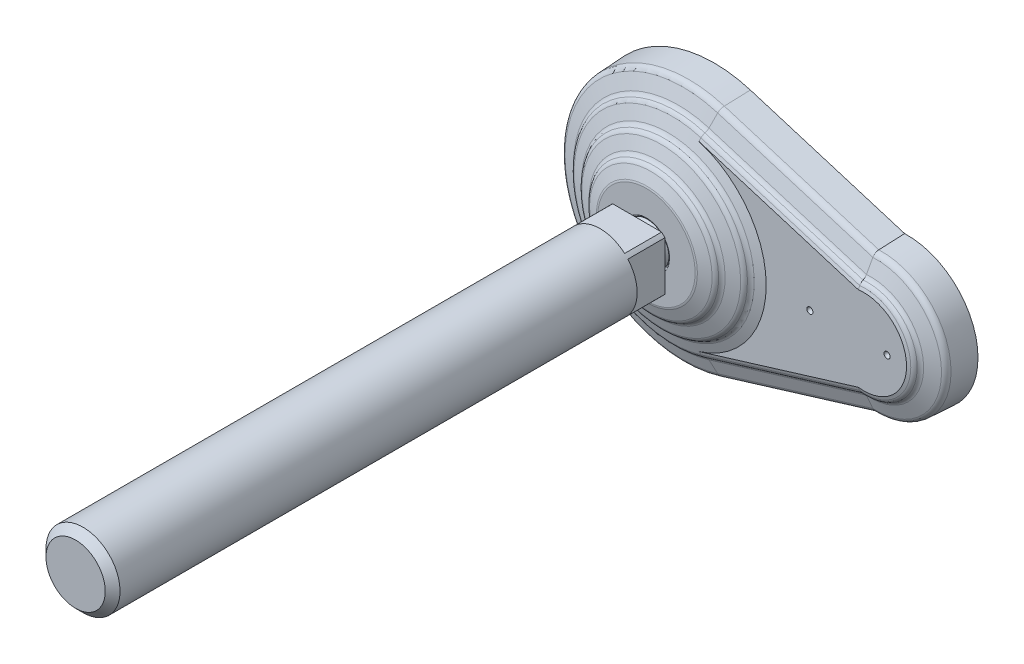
ISO-10303-21;
HEADER;
FILE_DESCRIPTION(('STEP AP214'),'2;1');
FILE_NAME('part.step','',(''),(''),'','','');
FILE_SCHEMA(('AUTOMOTIVE_DESIGN { 1 0 10303 214 1 1 1 1 }'));
ENDSEC;
DATA;
#1=APPLICATION_CONTEXT('core data for automotive mechanical design processes');
#2=APPLICATION_PROTOCOL_DEFINITION('international standard','automotive_design',2000,#1);
#3=PRODUCT_CONTEXT('',#1,'mechanical');
#4=PRODUCT('Part','Part','',(#3));
#5=PRODUCT_RELATED_PRODUCT_CATEGORY('part','',(#4));
#6=PRODUCT_DEFINITION_FORMATION('','',#4);
#7=PRODUCT_DEFINITION_CONTEXT('part definition',#1,'design');
#8=PRODUCT_DEFINITION('design','',#6,#7);
#9=PRODUCT_DEFINITION_SHAPE('','',#8);
#10=(LENGTH_UNIT() NAMED_UNIT(*) SI_UNIT(.MILLI.,.METRE.));
#11=(NAMED_UNIT(*) PLANE_ANGLE_UNIT() SI_UNIT($,.RADIAN.));
#12=(NAMED_UNIT(*) SI_UNIT($,.STERADIAN.) SOLID_ANGLE_UNIT());
#13=UNCERTAINTY_MEASURE_WITH_UNIT(LENGTH_MEASURE(1.E-05),#10,'distance_accuracy_value','');
#14=(GEOMETRIC_REPRESENTATION_CONTEXT(3) GLOBAL_UNCERTAINTY_ASSIGNED_CONTEXT((#13)) GLOBAL_UNIT_ASSIGNED_CONTEXT((#10,
#11,#12)) REPRESENTATION_CONTEXT('',''));
#15=CARTESIAN_POINT('',(0.,0.,0.));
#16=DIRECTION('',(0.,0.,1.));
#17=DIRECTION('',(1.,0.,0.));
#18=AXIS2_PLACEMENT_3D('',#15,#16,#17);
#19=CARTESIAN_POINT('',(0.,0.,39.));
#20=DIRECTION('',(0.,0.,1.));
#21=DIRECTION('',(-1.,0.,0.));
#22=AXIS2_PLACEMENT_3D('',#19,#20,#21);
#23=CYLINDRICAL_SURFACE('',#22,12.);
#24=CARTESIAN_POINT('',(0.,0.,206.6));
#25=DIRECTION('',(0.,0.,1.));
#26=DIRECTION('',(-1.,0.,0.));
#27=AXIS2_PLACEMENT_3D('',#24,#25,#26);
#28=CIRCLE('',#27,12.);
#29=CARTESIAN_POINT('',(-12.,0.,206.6));
#30=VERTEX_POINT('',#29);
#31=EDGE_CURVE('E9',#30,#30,#28,.F.);
#32=ORIENTED_EDGE('',*,*,#31,.T.);
#33=EDGE_LOOP('',(#32));
#34=FACE_BOUND('',#33,.T.);
#35=DIRECTION('',(0.,0.,1.));
#36=VECTOR('',#35,1.);
#37=CARTESIAN_POINT('',(-7.93725393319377,-9.,39.));
#38=LINE('',#37,#36);
#39=CARTESIAN_POINT('',(-7.93725393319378,-9.,39.));
#40=VERTEX_POINT('',#39);
#41=CARTESIAN_POINT('',(-7.93725393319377,-9.,27.));
#42=VERTEX_POINT('',#41);
#43=EDGE_CURVE('E159',#40,#42,#38,.F.);
#44=ORIENTED_EDGE('',*,*,#43,.F.);
#45=CARTESIAN_POINT('',(0.,0.,39.));
#46=DIRECTION('',(0.,0.,1.));
#47=DIRECTION('',(0.,-1.,0.));
#48=AXIS2_PLACEMENT_3D('',#45,#46,#47);
#49=CIRCLE('',#48,12.);
#50=CARTESIAN_POINT('',(7.93725393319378,-9.,39.));
#51=VERTEX_POINT('',#50);
#52=EDGE_CURVE('E805',#40,#51,#49,.T.);
#53=ORIENTED_EDGE('',*,*,#52,.T.);
#54=DIRECTION('',(0.,0.,1.));
#55=VECTOR('',#54,1.);
#56=CARTESIAN_POINT('',(7.93725393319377,-9.,39.));
#57=LINE('',#56,#55);
#58=CARTESIAN_POINT('',(7.93725393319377,-9.,27.));
#59=VERTEX_POINT('',#58);
#60=EDGE_CURVE('E224',#59,#51,#57,.T.);
#61=ORIENTED_EDGE('',*,*,#60,.F.);
#62=CARTESIAN_POINT('',(0.,0.,27.));
#63=DIRECTION('',(0.,0.,1.));
#64=DIRECTION('',(-1.,0.,0.));
#65=AXIS2_PLACEMENT_3D('',#62,#63,#64);
#66=CIRCLE('',#65,12.);
#67=CARTESIAN_POINT('',(9.,-7.93725393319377,27.));
#68=VERTEX_POINT('',#67);
#69=EDGE_CURVE('E207',#59,#68,#66,.T.);
#70=ORIENTED_EDGE('',*,*,#69,.T.);
#71=DIRECTION('',(0.,0.,1.));
#72=VECTOR('',#71,1.);
#73=CARTESIAN_POINT('',(9.,-7.93725393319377,39.));
#74=LINE('',#73,#72);
#75=CARTESIAN_POINT('',(9.,-7.93725393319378,39.));
#76=VERTEX_POINT('',#75);
#77=EDGE_CURVE('E221',#76,#68,#74,.F.);
#78=ORIENTED_EDGE('',*,*,#77,.F.);
#79=CARTESIAN_POINT('',(9.,7.93725393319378,39.));
#80=VERTEX_POINT('',#79);
#81=EDGE_CURVE('E301',#76,#80,#49,.T.);
#82=ORIENTED_EDGE('',*,*,#81,.T.);
#83=DIRECTION('',(0.,0.,1.));
#84=VECTOR('',#83,1.);
#85=CARTESIAN_POINT('',(9.,7.93725393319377,39.));
#86=LINE('',#85,#84);
#87=CARTESIAN_POINT('',(9.,7.93725393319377,27.));
#88=VERTEX_POINT('',#87);
#89=EDGE_CURVE('E266',#88,#80,#86,.T.);
#90=ORIENTED_EDGE('',*,*,#89,.F.);
#91=CARTESIAN_POINT('',(7.93725393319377,9.,27.));
#92=VERTEX_POINT('',#91);
#93=EDGE_CURVE('E203',#88,#92,#66,.T.);
#94=ORIENTED_EDGE('',*,*,#93,.T.);
#95=DIRECTION('',(0.,0.,1.));
#96=VECTOR('',#95,1.);
#97=CARTESIAN_POINT('',(7.93725393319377,9.,39.));
#98=LINE('',#97,#96);
#99=CARTESIAN_POINT('',(7.93725393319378,9.,39.));
#100=VERTEX_POINT('',#99);
#101=EDGE_CURVE('E184',#100,#92,#98,.F.);
#102=ORIENTED_EDGE('',*,*,#101,.F.);
#103=CARTESIAN_POINT('',(-7.93725393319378,9.,39.));
#104=VERTEX_POINT('',#103);
#105=EDGE_CURVE('E197',#100,#104,#49,.T.);
#106=ORIENTED_EDGE('',*,*,#105,.T.);
#107=DIRECTION('',(0.,0.,1.));
#108=VECTOR('',#107,1.);
#109=CARTESIAN_POINT('',(-7.93725393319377,9.,39.));
#110=LINE('',#109,#108);
#111=CARTESIAN_POINT('',(-7.93725393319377,9.,27.));
#112=VERTEX_POINT('',#111);
#113=EDGE_CURVE('E182',#112,#104,#110,.T.);
#114=ORIENTED_EDGE('',*,*,#113,.F.);
#115=CARTESIAN_POINT('',(-9.,7.93725393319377,27.));
#116=VERTEX_POINT('',#115);
#117=EDGE_CURVE('E195',#112,#116,#66,.T.);
#118=ORIENTED_EDGE('',*,*,#117,.T.);
#119=DIRECTION('',(0.,0.,1.));
#120=VECTOR('',#119,1.);
#121=CARTESIAN_POINT('',(-9.,7.93725393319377,39.));
#122=LINE('',#121,#120);
#123=CARTESIAN_POINT('',(-9.,7.93725393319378,39.));
#124=VERTEX_POINT('',#123);
#125=EDGE_CURVE('E198',#124,#116,#122,.F.);
#126=ORIENTED_EDGE('',*,*,#125,.F.);
#127=CARTESIAN_POINT('',(-9.,-7.93725393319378,39.));
#128=VERTEX_POINT('',#127);
#129=EDGE_CURVE('E806',#124,#128,#49,.T.);
#130=ORIENTED_EDGE('',*,*,#129,.T.);
#131=DIRECTION('',(0.,0.,1.));
#132=VECTOR('',#131,1.);
#133=CARTESIAN_POINT('',(-9.,-7.93725393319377,39.));
#134=LINE('',#133,#132);
#135=CARTESIAN_POINT('',(-9.,-7.93725393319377,27.));
#136=VERTEX_POINT('',#135);
#137=EDGE_CURVE('E204',#136,#128,#134,.T.);
#138=ORIENTED_EDGE('',*,*,#137,.F.);
#139=EDGE_CURVE('E206',#136,#42,#66,.T.);
#140=ORIENTED_EDGE('',*,*,#139,.T.);
#141=EDGE_LOOP('',(#44,#53,#61,#70,#78,#82,#90,#94,#102,#106,#114,#118,#126,#130,#138,#140));
#142=FACE_BOUND('',#141,.T.);
#143=ADVANCED_FACE('F15',(#34,#142),#23,.T.);
#144=CARTESIAN_POINT('',(-5.26544933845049,0.,27.));
#145=DIRECTION('',(0.,0.,1.));
#146=DIRECTION('',(-1.,0.,0.));
#147=AXIS2_PLACEMENT_3D('',#144,#145,#146);
#148=PLANE('',#147);
#149=DIRECTION('',(0.,-1.,0.));
#150=VECTOR('',#149,1.);
#151=CARTESIAN_POINT('',(-9.,9.,27.));
#152=LINE('',#151,#150);
#153=EDGE_CURVE('E32',#116,#136,#152,.T.);
#154=ORIENTED_EDGE('',*,*,#153,.F.);
#155=ORIENTED_EDGE('',*,*,#117,.F.);
#156=DIRECTION('',(-1.,0.,0.));
#157=VECTOR('',#156,1.);
#158=CARTESIAN_POINT('',(9.,9.,27.));
#159=LINE('',#158,#157);
#160=EDGE_CURVE('E177',#92,#112,#159,.T.);
#161=ORIENTED_EDGE('',*,*,#160,.F.);
#162=ORIENTED_EDGE('',*,*,#93,.F.);
#163=DIRECTION('',(0.,1.,0.));
#164=VECTOR('',#163,1.);
#165=CARTESIAN_POINT('',(9.,-9.,27.));
#166=LINE('',#165,#164);
#167=EDGE_CURVE('E189',#68,#88,#166,.T.);
#168=ORIENTED_EDGE('',*,*,#167,.F.);
#169=ORIENTED_EDGE('',*,*,#69,.F.);
#170=DIRECTION('',(1.,0.,0.));
#171=VECTOR('',#170,1.);
#172=CARTESIAN_POINT('',(-9.,-9.,27.));
#173=LINE('',#172,#171);
#174=EDGE_CURVE('E226',#42,#59,#173,.T.);
#175=ORIENTED_EDGE('',*,*,#174,.F.);
#176=ORIENTED_EDGE('',*,*,#139,.F.);
#177=EDGE_LOOP('',(#154,#155,#161,#162,#168,#169,#175,#176));
#178=FACE_BOUND('',#177,.T.);
#179=CARTESIAN_POINT('',(0.,0.,27.));
#180=DIRECTION('',(0.,0.,1.));
#181=DIRECTION('',(-1.,0.,0.));
#182=AXIS2_PLACEMENT_3D('',#179,#180,#181);
#183=CIRCLE('',#182,5.26544933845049);
#184=CARTESIAN_POINT('',(-5.26544933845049,0.,27.));
#185=VERTEX_POINT('',#184);
#186=EDGE_CURVE('E212',#185,#185,#183,.T.);
#187=ORIENTED_EDGE('',*,*,#186,.T.);
#188=EDGE_LOOP('',(#187));
#189=FACE_BOUND('',#188,.T.);
#190=ADVANCED_FACE('F200',(#178,#189),#148,.F.);
#191=CARTESIAN_POINT('',(0.,0.,20.6509999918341));
#192=DIRECTION('',(0.,0.,1.));
#193=DIRECTION('',(-1.,0.,0.));
#194=AXIS2_PLACEMENT_3D('',#191,#192,#193);
#195=DEGENERATE_TOROIDAL_SURFACE('',#194,0.000333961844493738,6.829,.T.);
#196=CARTESIAN_POINT('',(0.,0.,21.794));
#197=DIRECTION('',(0.,0.,-1.));
#198=DIRECTION('',(1.,0.,0.));
#199=AXIS2_PLACEMENT_3D('',#196,#197,#198);
#200=CIRCLE('',#199,6.733);
#201=CARTESIAN_POINT('',(6.733,0.,21.794));
#202=VERTEX_POINT('',#201);
#203=EDGE_CURVE('E273',#202,#202,#200,.T.);
#204=ORIENTED_EDGE('',*,*,#203,.F.);
#205=EDGE_LOOP('',(#204));
#206=FACE_BOUND('',#205,.T.);
#207=CARTESIAN_POINT('',(0.,0.,25.));
#208=DIRECTION('',(0.,0.,1.));
#209=DIRECTION('',(-1.,0.,0.));
#210=AXIS2_PLACEMENT_3D('',#207,#208,#209);
#211=CIRCLE('',#210,5.2654493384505);
#212=CARTESIAN_POINT('',(-5.2654493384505,0.,25.));
#213=VERTEX_POINT('',#212);
#214=EDGE_CURVE('E214',#213,#213,#211,.T.);
#215=ORIENTED_EDGE('',*,*,#214,.F.);
#216=EDGE_LOOP('',(#215));
#217=FACE_BOUND('',#216,.T.);
#218=ADVANCED_FACE('F512',(#206,#217),#195,.T.);
#219=CARTESIAN_POINT('',(0.,0.,39.));
#220=DIRECTION('',(0.,0.,1.));
#221=DIRECTION('',(-1.,0.,0.));
#222=AXIS2_PLACEMENT_3D('',#219,#220,#221);
#223=CYLINDRICAL_SURFACE('',#222,5.2654493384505);
#224=ORIENTED_EDGE('',*,*,#186,.F.);
#225=EDGE_LOOP('',(#224));
#226=FACE_BOUND('',#225,.T.);
#227=ORIENTED_EDGE('',*,*,#214,.T.);
#228=EDGE_LOOP('',(#227));
#229=FACE_BOUND('',#228,.T.);
#230=ADVANCED_FACE('F780',(#226,#229),#223,.T.);
#231=CARTESIAN_POINT('',(-9.,-9.,27.));
#232=DIRECTION('',(0.,-1.,0.));
#233=DIRECTION('',(1.,0.,0.));
#234=AXIS2_PLACEMENT_3D('',#231,#232,#233);
#235=PLANE('',#234);
#236=ORIENTED_EDGE('',*,*,#60,.T.);
#237=DIRECTION('',(-1.,0.,0.));
#238=VECTOR('',#237,1.);
#239=CARTESIAN_POINT('',(-12.,-9.,39.));
#240=LINE('',#239,#238);
#241=EDGE_CURVE('E238',#51,#40,#240,.T.);
#242=ORIENTED_EDGE('',*,*,#241,.T.);
#243=ORIENTED_EDGE('',*,*,#43,.T.);
#244=ORIENTED_EDGE('',*,*,#174,.T.);
#245=EDGE_LOOP('',(#236,#242,#243,#244));
#246=FACE_BOUND('',#245,.T.);
#247=ADVANCED_FACE('F778',(#246),#235,.T.);
#248=CARTESIAN_POINT('',(9.,-9.,27.));
#249=DIRECTION('',(1.,0.,0.));
#250=DIRECTION('',(0.,1.,0.));
#251=AXIS2_PLACEMENT_3D('',#248,#249,#250);
#252=PLANE('',#251);
#253=ORIENTED_EDGE('',*,*,#89,.T.);
#254=DIRECTION('',(0.,-1.,0.));
#255=VECTOR('',#254,1.);
#256=CARTESIAN_POINT('',(9.,0.,39.));
#257=LINE('',#256,#255);
#258=EDGE_CURVE('E245',#80,#76,#257,.T.);
#259=ORIENTED_EDGE('',*,*,#258,.T.);
#260=ORIENTED_EDGE('',*,*,#77,.T.);
#261=ORIENTED_EDGE('',*,*,#167,.T.);
#262=EDGE_LOOP('',(#253,#259,#260,#261));
#263=FACE_BOUND('',#262,.T.);
#264=ADVANCED_FACE('F774',(#263),#252,.T.);
#265=CARTESIAN_POINT('',(9.,9.,27.));
#266=DIRECTION('',(0.,1.,0.));
#267=DIRECTION('',(-1.,0.,0.));
#268=AXIS2_PLACEMENT_3D('',#265,#266,#267);
#269=PLANE('',#268);
#270=ORIENTED_EDGE('',*,*,#113,.T.);
#271=DIRECTION('',(1.,0.,0.));
#272=VECTOR('',#271,1.);
#273=CARTESIAN_POINT('',(-12.,9.,39.));
#274=LINE('',#273,#272);
#275=EDGE_CURVE('E249',#104,#100,#274,.T.);
#276=ORIENTED_EDGE('',*,*,#275,.T.);
#277=ORIENTED_EDGE('',*,*,#101,.T.);
#278=ORIENTED_EDGE('',*,*,#160,.T.);
#279=EDGE_LOOP('',(#270,#276,#277,#278));
#280=FACE_BOUND('',#279,.T.);
#281=ADVANCED_FACE('F179',(#280),#269,.T.);
#282=CARTESIAN_POINT('',(-9.,9.,27.));
#283=DIRECTION('',(-1.,0.,0.));
#284=DIRECTION('',(0.,-1.,0.));
#285=AXIS2_PLACEMENT_3D('',#282,#283,#284);
#286=PLANE('',#285);
#287=ORIENTED_EDGE('',*,*,#137,.T.);
#288=DIRECTION('',(0.,1.,0.));
#289=VECTOR('',#288,1.);
#290=CARTESIAN_POINT('',(-9.,0.,39.));
#291=LINE('',#290,#289);
#292=EDGE_CURVE('E262',#128,#124,#291,.T.);
#293=ORIENTED_EDGE('',*,*,#292,.T.);
#294=ORIENTED_EDGE('',*,*,#125,.T.);
#295=ORIENTED_EDGE('',*,*,#153,.T.);
#296=EDGE_LOOP('',(#287,#293,#294,#295));
#297=FACE_BOUND('',#296,.T.);
#298=ADVANCED_FACE('F754',(#297),#286,.T.);
#299=CARTESIAN_POINT('',(0.,0.,0.));
#300=DIRECTION('',(0.,0.,1.));
#301=DIRECTION('',(0.,-1.,0.));
#302=AXIS2_PLACEMENT_3D('',#299,#300,#301);
#303=PLANE('',#302);
#304=DIRECTION('',(-0.951485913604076,0.307692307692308,0.));
#305=VECTOR('',#304,1.);
#306=CARTESIAN_POINT('',(69.9230769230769,15.2237746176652,0.));
#307=LINE('',#306,#305);
#308=CARTESIAN_POINT('',(69.9230769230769,15.2237746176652,0.));
#309=VERTEX_POINT('',#308);
#310=CARTESIAN_POINT('',(11.0769230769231,34.2534928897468,0.));
#311=VERTEX_POINT('',#310);
#312=EDGE_CURVE('E285',#309,#311,#307,.T.);
#313=ORIENTED_EDGE('',*,*,#312,.F.);
#314=CARTESIAN_POINT('',(65.,0.,0.));
#315=DIRECTION('',(0.,0.,1.));
#316=DIRECTION('',(1.,0.,0.));
#317=AXIS2_PLACEMENT_3D('',#314,#315,#316);
#318=CIRCLE('',#317,16.);
#319=CARTESIAN_POINT('',(69.9230769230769,-15.2237746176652,0.));
#320=VERTEX_POINT('',#319);
#321=EDGE_CURVE('E295',#320,#309,#318,.T.);
#322=ORIENTED_EDGE('',*,*,#321,.F.);
#323=DIRECTION('',(0.951485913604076,0.307692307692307,0.));
#324=VECTOR('',#323,1.);
#325=CARTESIAN_POINT('',(11.0769230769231,-34.2534928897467,0.));
#326=LINE('',#325,#324);
#327=CARTESIAN_POINT('',(11.0769230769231,-34.2534928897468,0.));
#328=VERTEX_POINT('',#327);
#329=EDGE_CURVE('E292',#328,#320,#326,.T.);
#330=ORIENTED_EDGE('',*,*,#329,.F.);
#331=CARTESIAN_POINT('',(0.,0.,0.));
#332=DIRECTION('',(0.,0.,1.));
#333=DIRECTION('',(1.,0.,0.));
#334=AXIS2_PLACEMENT_3D('',#331,#332,#333);
#335=CIRCLE('',#334,36.);
#336=EDGE_CURVE('E288',#311,#328,#335,.T.);
#337=ORIENTED_EDGE('',*,*,#336,.F.);
#338=EDGE_LOOP('',(#313,#322,#330,#337));
#339=FACE_BOUND('',#338,.T.);
#340=ADVANCED_FACE('F514',(#339),#303,.F.);
#341=CARTESIAN_POINT('',(11.0769230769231,-34.2534928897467,0.));
#342=DIRECTION('',(0.307692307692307,-0.951485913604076,0.));
#343=DIRECTION('',(0.951485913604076,0.307692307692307,0.));
#344=AXIS2_PLACEMENT_3D('',#341,#342,#343);
#345=PLANE('',#344);
#346=DIRECTION('',(0.951485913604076,0.307692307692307,0.));
#347=VECTOR('',#346,1.);
#348=CARTESIAN_POINT('',(11.0769230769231,-34.2534928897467,2.));
#349=LINE('',#348,#347);
#350=CARTESIAN_POINT('',(11.0769230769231,-34.2534928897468,2.));
#351=VERTEX_POINT('',#350);
#352=CARTESIAN_POINT('',(69.9230769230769,-15.2237746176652,2.));
#353=VERTEX_POINT('',#352);
#354=EDGE_CURVE('E304',#351,#353,#349,.T.);
#355=ORIENTED_EDGE('',*,*,#354,.F.);
#356=DIRECTION('',(0.,0.,1.));
#357=VECTOR('',#356,1.);
#358=CARTESIAN_POINT('',(11.0769230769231,-34.2534928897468,0.));
#359=LINE('',#358,#357);
#360=EDGE_CURVE('E312',#328,#351,#359,.T.);
#361=ORIENTED_EDGE('',*,*,#360,.F.);
#362=ORIENTED_EDGE('',*,*,#329,.T.);
#363=DIRECTION('',(0.,0.,1.));
#364=VECTOR('',#363,1.);
#365=CARTESIAN_POINT('',(69.9230769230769,-15.2237746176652,0.));
#366=LINE('',#365,#364);
#367=EDGE_CURVE('E310',#320,#353,#366,.T.);
#368=ORIENTED_EDGE('',*,*,#367,.T.);
#369=EDGE_LOOP('',(#355,#361,#362,#368));
#370=FACE_BOUND('',#369,.T.);
#371=ADVANCED_FACE('F771',(#370),#345,.T.);
#372=CARTESIAN_POINT('',(0.,0.,0.));
#373=DIRECTION('',(0.,0.,1.));
#374=DIRECTION('',(0.,-1.,0.));
#375=AXIS2_PLACEMENT_3D('',#372,#373,#374);
#376=CYLINDRICAL_SURFACE('',#375,36.);
#377=CARTESIAN_POINT('',(0.,0.,2.));
#378=DIRECTION('',(0.,0.,1.));
#379=DIRECTION('',(1.,0.,0.));
#380=AXIS2_PLACEMENT_3D('',#377,#378,#379);
#381=CIRCLE('',#380,36.);
#382=CARTESIAN_POINT('',(11.0769230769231,34.2534928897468,2.));
#383=VERTEX_POINT('',#382);
#384=EDGE_CURVE('E300',#383,#351,#381,.T.);
#385=ORIENTED_EDGE('',*,*,#384,.F.);
#386=DIRECTION('',(0.,0.,1.));
#387=VECTOR('',#386,1.);
#388=CARTESIAN_POINT('',(11.0769230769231,34.2534928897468,0.));
#389=LINE('',#388,#387);
#390=EDGE_CURVE('E314',#311,#383,#389,.T.);
#391=ORIENTED_EDGE('',*,*,#390,.F.);
#392=ORIENTED_EDGE('',*,*,#336,.T.);
#393=ORIENTED_EDGE('',*,*,#360,.T.);
#394=EDGE_LOOP('',(#385,#391,#392,#393));
#395=FACE_BOUND('',#394,.T.);
#396=ADVANCED_FACE('F1138',(#395),#376,.T.);
#397=CARTESIAN_POINT('',(69.9230769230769,15.2237746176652,0.));
#398=DIRECTION('',(0.307692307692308,0.951485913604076,0.));
#399=DIRECTION('',(-0.951485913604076,0.307692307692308,0.));
#400=AXIS2_PLACEMENT_3D('',#397,#398,#399);
#401=PLANE('',#400);
#402=DIRECTION('',(-0.951485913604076,0.307692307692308,0.));
#403=VECTOR('',#402,1.);
#404=CARTESIAN_POINT('',(69.9230769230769,15.2237746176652,2.));
#405=LINE('',#404,#403);
#406=CARTESIAN_POINT('',(69.9230769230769,15.2237746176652,2.));
#407=VERTEX_POINT('',#406);
#408=EDGE_CURVE('E150',#407,#383,#405,.T.);
#409=ORIENTED_EDGE('',*,*,#408,.F.);
#410=DIRECTION('',(0.,0.,1.));
#411=VECTOR('',#410,1.);
#412=CARTESIAN_POINT('',(69.9230769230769,15.2237746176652,0.));
#413=LINE('',#412,#411);
#414=EDGE_CURVE('E298',#309,#407,#413,.T.);
#415=ORIENTED_EDGE('',*,*,#414,.F.);
#416=ORIENTED_EDGE('',*,*,#312,.T.);
#417=ORIENTED_EDGE('',*,*,#390,.T.);
#418=EDGE_LOOP('',(#409,#415,#416,#417));
#419=FACE_BOUND('',#418,.T.);
#420=ADVANCED_FACE('F538',(#419),#401,.T.);
#421=CARTESIAN_POINT('',(65.,0.,0.));
#422=DIRECTION('',(0.,0.,1.));
#423=DIRECTION('',(0.,-1.,0.));
#424=AXIS2_PLACEMENT_3D('',#421,#422,#423);
#425=CYLINDRICAL_SURFACE('',#424,16.);
#426=CARTESIAN_POINT('',(65.,0.,2.));
#427=DIRECTION('',(0.,0.,1.));
#428=DIRECTION('',(1.,0.,0.));
#429=AXIS2_PLACEMENT_3D('',#426,#427,#428);
#430=CIRCLE('',#429,16.);
#431=EDGE_CURVE('E289',#353,#407,#430,.T.);
#432=ORIENTED_EDGE('',*,*,#431,.F.);
#433=ORIENTED_EDGE('',*,*,#367,.F.);
#434=ORIENTED_EDGE('',*,*,#321,.T.);
#435=ORIENTED_EDGE('',*,*,#414,.T.);
#436=EDGE_LOOP('',(#432,#433,#434,#435));
#437=FACE_BOUND('',#436,.T.);
#438=ADVANCED_FACE('F523',(#437),#425,.T.);
#439=CARTESIAN_POINT('',(62.5,0.,2.));
#440=DIRECTION('',(0.,0.,-1.));
#441=DIRECTION('',(0.,1.,0.));
#442=AXIS2_PLACEMENT_3D('',#439,#440,#441);
#443=CONICAL_SURFACE('',#442,22.9787234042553,0.0523365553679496);
#444=CARTESIAN_POINT('',(62.5,0.,10.3041173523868));
#445=DIRECTION('',(0.,0.,1.));
#446=DIRECTION('',(0.,-1.,0.));
#447=AXIS2_PLACEMENT_3D('',#444,#445,#446);
#448=CIRCLE('',#447,22.5437172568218);
#449=CARTESIAN_POINT('',(61.6407011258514,-22.5273343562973,10.3041173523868));
#450=VERTEX_POINT('',#449);
#451=CARTESIAN_POINT('',(61.6407011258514,22.5273343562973,10.3041173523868));
#452=VERTEX_POINT('',#451);
#453=EDGE_CURVE('E344',#450,#452,#448,.T.);
#454=ORIENTED_EDGE('',*,*,#453,.F.);
#455=CARTESIAN_POINT('',(61.6406997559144,-22.5273238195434,10.3043173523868));
#456=CARTESIAN_POINT('',(61.6501805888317,-22.600242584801,8.92023165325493));
#457=CARTESIAN_POINT('',(61.6596900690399,-22.6731526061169,7.53614569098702));
#458=CARTESIAN_POINT('',(61.6787663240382,-22.8189551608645,4.76797324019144));
#459=CARTESIAN_POINT('',(61.6883330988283,-22.8918476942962,3.38388675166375));
#460=CARTESIAN_POINT('',(61.6979285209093,-22.9647314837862,1.9998));
#461=B_SPLINE_CURVE_WITH_KNOTS('',3,(#455,#456,#457,#458,#459,#460),.UNSPECIFIED.,.F.,.F.,(4,2,
4),(0.,4.15811282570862,8.31622565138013),.UNSPECIFIED.);
#462=CARTESIAN_POINT('',(61.697927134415,-22.9647209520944,2.));
#463=VERTEX_POINT('',#462);
#464=EDGE_CURVE('E651',#450,#463,#461,.T.);
#465=ORIENTED_EDGE('',*,*,#464,.T.);
#466=CARTESIAN_POINT('',(62.5,0.,2.));
#467=DIRECTION('',(0.,0.,1.));
#468=DIRECTION('',(0.,-1.,0.));
#469=AXIS2_PLACEMENT_3D('',#466,#467,#468);
#470=CIRCLE('',#469,22.9787234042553);
#471=CARTESIAN_POINT('',(61.6979271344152,22.9647209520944,2.));
#472=VERTEX_POINT('',#471);
#473=EDGE_CURVE('E346',#463,#472,#470,.T.);
#474=ORIENTED_EDGE('',*,*,#473,.T.);
#475=CARTESIAN_POINT('',(61.6979285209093,22.9647314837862,1.9998));
#476=CARTESIAN_POINT('',(61.6883330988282,22.8918476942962,3.38388675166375));
#477=CARTESIAN_POINT('',(61.6787663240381,22.8189551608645,4.76797324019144));
#478=CARTESIAN_POINT('',(61.6596900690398,22.6731526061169,7.53614569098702));
#479=CARTESIAN_POINT('',(61.6501805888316,22.600242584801,8.92023165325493));
#480=CARTESIAN_POINT('',(61.6406997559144,22.5273238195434,10.3043173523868));
#481=B_SPLINE_CURVE_WITH_KNOTS('',3,(#475,#476,#477,#478,#479,#480),.UNSPECIFIED.,.F.,.F.,(4,2,
4),(0.,4.15811282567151,8.31622565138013),.UNSPECIFIED.);
#482=EDGE_CURVE('E697',#472,#452,#481,.T.);
#483=ORIENTED_EDGE('',*,*,#482,.T.);
#484=EDGE_LOOP('',(#454,#465,#474,#483));
#485=FACE_BOUND('',#484,.T.);
#486=ADVANCED_FACE('F517',(#485),#443,.T.);
#487=CARTESIAN_POINT('',(64.1644462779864,-21.755748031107,10.3041173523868));
#488=DIRECTION('',(-0.291971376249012,0.9549953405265,-0.0523126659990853));
#489=DIRECTION('',(-0.956304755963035,-0.292371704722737,0.));
#490=AXIS2_PLACEMENT_3D('',#487,#488,#489);
#491=PLANE('',#490);
#492=ORIENTED_EDGE('',*,*,#464,.F.);
#493=DIRECTION('',(-0.956304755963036,-0.292371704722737,0.));
#494=VECTOR('',#493,1.);
#495=CARTESIAN_POINT('',(64.1644462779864,-21.755748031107,10.3041173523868));
#496=LINE('',#495,#494);
#497=CARTESIAN_POINT('',(11.5676847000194,-37.8361917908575,10.3041173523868));
#498=VERTEX_POINT('',#497);
#499=EDGE_CURVE('E600',#450,#498,#496,.T.);
#500=ORIENTED_EDGE('',*,*,#499,.T.);
#501=DIRECTION('',(-0.0152947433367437,0.050026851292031,0.998630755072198));
#502=VECTOR('',#501,1.);
#503=CARTESIAN_POINT('',(11.6948681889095,-38.2521902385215,2.));
#504=LINE('',#503,#502);
#505=CARTESIAN_POINT('',(11.6948681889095,-38.2521902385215,2.));
#506=VERTEX_POINT('',#505);
#507=EDGE_CURVE('E606',#506,#498,#504,.T.);
#508=ORIENTED_EDGE('',*,*,#507,.F.);
#509=DIRECTION('',(-0.956304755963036,-0.292371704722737,0.));
#510=VECTOR('',#509,1.);
#511=CARTESIAN_POINT('',(64.2916297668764,-22.1717464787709,2.));
#512=LINE('',#511,#510);
#513=EDGE_CURVE('E144',#463,#506,#512,.T.);
#514=ORIENTED_EDGE('',*,*,#513,.F.);
#515=EDGE_LOOP('',(#492,#500,#508,#514));
#516=FACE_BOUND('',#515,.T.);
#517=ADVANCED_FACE('F508',(#516),#491,.F.);
#518=CARTESIAN_POINT('',(0.,0.,2.));
#519=DIRECTION('',(0.,0.,1.));
#520=DIRECTION('',(-1.,0.,0.));
#521=AXIS2_PLACEMENT_3D('',#518,#519,#520);
#522=PLANE('',#521);
#523=DIRECTION('',(-0.956304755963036,0.292371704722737,0.));
#524=VECTOR('',#523,1.);
#525=CARTESIAN_POINT('',(64.2916297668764,22.1717464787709,2.));
#526=LINE('',#525,#524);
#527=CARTESIAN_POINT('',(11.6948681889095,38.2521902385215,2.));
#528=VERTEX_POINT('',#527);
#529=EDGE_CURVE('E653',#472,#528,#526,.T.);
#530=ORIENTED_EDGE('',*,*,#529,.F.);
#531=ORIENTED_EDGE('',*,*,#473,.F.);
#532=ORIENTED_EDGE('',*,*,#513,.T.);
#533=CARTESIAN_POINT('',(0.,0.,2.));
#534=DIRECTION('',(0.,0.,1.));
#535=DIRECTION('',(-1.,0.,0.));
#536=AXIS2_PLACEMENT_3D('',#533,#534,#535);
#537=CIRCLE('',#536,40.);
#538=EDGE_CURVE('E389',#528,#506,#537,.T.);
#539=ORIENTED_EDGE('',*,*,#538,.F.);
#540=EDGE_LOOP('',(#530,#531,#532,#539));
#541=FACE_BOUND('',#540,.T.);
#542=ORIENTED_EDGE('',*,*,#431,.T.);
#543=ORIENTED_EDGE('',*,*,#408,.T.);
#544=ORIENTED_EDGE('',*,*,#384,.T.);
#545=ORIENTED_EDGE('',*,*,#354,.T.);
#546=EDGE_LOOP('',(#542,#543,#544,#545));
#547=FACE_BOUND('',#546,.T.);
#548=ADVANCED_FACE('F398',(#541,#547),#522,.F.);
#549=CARTESIAN_POINT('',(64.2916297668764,22.1717464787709,2.));
#550=DIRECTION('',(-0.291971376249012,-0.9549953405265,-0.0523126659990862));
#551=DIRECTION('',(0.956304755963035,-0.292371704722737,0.));
#552=AXIS2_PLACEMENT_3D('',#549,#550,#551);
#553=PLANE('',#552);
#554=ORIENTED_EDGE('',*,*,#482,.F.);
#555=ORIENTED_EDGE('',*,*,#529,.T.);
#556=DIRECTION('',(-0.0152947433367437,-0.050026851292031,0.998630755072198));
#557=VECTOR('',#556,1.);
#558=CARTESIAN_POINT('',(11.6948681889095,38.2521902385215,2.));
#559=LINE('',#558,#557);
#560=CARTESIAN_POINT('',(11.5676847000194,37.8361917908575,10.3041173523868));
#561=VERTEX_POINT('',#560);
#562=EDGE_CURVE('E620',#528,#561,#559,.T.);
#563=ORIENTED_EDGE('',*,*,#562,.T.);
#564=DIRECTION('',(-0.956304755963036,0.292371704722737,0.));
#565=VECTOR('',#564,1.);
#566=CARTESIAN_POINT('',(64.1644462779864,21.755748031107,10.3041173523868));
#567=LINE('',#566,#565);
#568=EDGE_CURVE('E654',#452,#561,#567,.T.);
#569=ORIENTED_EDGE('',*,*,#568,.F.);
#570=EDGE_LOOP('',(#554,#555,#563,#569));
#571=FACE_BOUND('',#570,.T.);
#572=ADVANCED_FACE('F478',(#571),#553,.F.);
#573=CARTESIAN_POINT('',(62.5,0.,10.1991258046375));
#574=DIRECTION('',(0.,0.,1.));
#575=DIRECTION('',(0.,-1.,0.));
#576=AXIS2_PLACEMENT_3D('',#573,#574,#575);
#577=TOROIDAL_SURFACE('',#576,20.5394653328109,2.007);
#578=CARTESIAN_POINT('',(61.6407233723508,-22.5275054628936,10.0974340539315));
#579=CARTESIAN_POINT('',(61.6409510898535,-22.5292569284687,10.1317993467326));
#580=CARTESIAN_POINT('',(61.6410635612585,-22.5301219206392,10.1661964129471));
#581=CARTESIAN_POINT('',(61.6410572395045,-22.5300732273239,10.235045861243));
#582=CARTESIAN_POINT('',(61.6409380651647,-22.5291566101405,10.2694982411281));
#583=CARTESIAN_POINT('',(61.6399396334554,-22.5214778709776,10.4153785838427));
#584=CARTESIAN_POINT('',(61.6379561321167,-22.5062239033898,10.526490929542));
#585=CARTESIAN_POINT('',(61.6316126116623,-22.4573679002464,10.7446232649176));
#586=CARTESIAN_POINT('',(61.6272490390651,-22.4237384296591,10.8516368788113));
#587=CARTESIAN_POINT('',(61.6163034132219,-22.339189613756,11.058357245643));
#588=CARTESIAN_POINT('',(61.6097238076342,-22.2882893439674,11.1580719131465));
#589=CARTESIAN_POINT('',(61.5945702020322,-22.1707054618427,11.3475467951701));
#590=CARTESIAN_POINT('',(61.5859960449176,-22.1040206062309,11.4373062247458));
#591=CARTESIAN_POINT('',(61.5670698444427,-21.9562760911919,11.6050783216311));
#592=CARTESIAN_POINT('',(61.5567047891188,-21.8751110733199,11.6829965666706));
#593=CARTESIAN_POINT('',(61.5345911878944,-21.7011851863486,11.8241014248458));
#594=CARTESIAN_POINT('',(61.5228449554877,-21.6084436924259,11.8873121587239));
#595=CARTESIAN_POINT('',(61.5046129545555,-21.4637836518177,11.9692866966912));
#596=CARTESIAN_POINT('',(61.4985079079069,-21.4152343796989,11.9942523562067));
#597=CARTESIAN_POINT('',(61.4860940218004,-21.3162718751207,12.0401972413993));
#598=CARTESIAN_POINT('',(61.4797850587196,-21.2658575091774,12.0611739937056));
#599=CARTESIAN_POINT('',(61.4596293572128,-21.1043762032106,12.1208327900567));
#600=CARTESIAN_POINT('',(61.4454888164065,-20.9904779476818,12.1519983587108));
#601=CARTESIAN_POINT('',(61.4169436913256,-20.7591475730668,12.1941665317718));
#602=CARTESIAN_POINT('',(61.4025394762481,-20.6417202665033,12.2051954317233));
#603=CARTESIAN_POINT('',(61.3876252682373,-20.5193667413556,12.2061070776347));
#604=CARTESIAN_POINT('',(61.3870090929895,-20.5143103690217,12.2061258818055));
#605=CARTESIAN_POINT('',(61.3863931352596,-20.5092543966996,12.2061258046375));
#606=B_SPLINE_CURVE_WITH_KNOTS('',3,(#578,#579,#580,#581,#582,#583,#584,#585,#586,#587,#588,
#589,#590,#591,#592,#593,#594,#595,#596,#597,#598,#599,#600,#601,#602,#603,#604,#605),
.UNSPECIFIED.,.F.,.F.,(4,2,2,2,2,2,2,2,2,2,2,2,2,4),(0.,0.103191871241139,0.20655369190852,
0.541275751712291,0.87649892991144,1.21135305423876,1.54623356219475,1.8836582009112,
2.22052549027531,2.38517216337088,2.54992059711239,2.9048600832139,3.25933573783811,
3.2746170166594),.UNSPECIFIED.);
#607=CARTESIAN_POINT('',(61.4734629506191,-21.2152067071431,12.0798866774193));
#608=VERTEX_POINT('',#607);
#609=EDGE_CURVE('E1245',#450,#608,#606,.T.);
#610=ORIENTED_EDGE('',*,*,#609,.F.);
#611=ORIENTED_EDGE('',*,*,#453,.T.);
#612=CARTESIAN_POINT('',(61.3863931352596,20.5092543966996,12.2061258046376));
#613=CARTESIAN_POINT('',(61.3870091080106,20.5143104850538,12.2061258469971));
#614=CARTESIAN_POINT('',(61.3876252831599,20.5193668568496,12.206107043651));
#615=CARTESIAN_POINT('',(61.3988855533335,20.6117442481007,12.2054193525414));
#616=CARTESIAN_POINT('',(61.4095840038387,20.6991031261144,12.1991511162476));
#617=CARTESIAN_POINT('',(61.4308936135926,20.8723273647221,12.1754412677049));
#618=CARTESIAN_POINT('',(61.4415047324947,20.9581920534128,12.1579947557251));
#619=CARTESIAN_POINT('',(61.4555813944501,21.0716202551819,12.1272225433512));
#620=CARTESIAN_POINT('',(61.4591730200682,21.1005182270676,12.1186877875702));
#621=CARTESIAN_POINT('',(61.4663157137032,21.1579059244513,12.1003430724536));
#622=CARTESIAN_POINT('',(61.4698667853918,21.1863956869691,12.090533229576));
#623=CARTESIAN_POINT('',(61.4866782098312,21.3210820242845,12.0407628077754));
#624=CARTESIAN_POINT('',(61.4996430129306,21.4243838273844,11.9924168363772));
#625=CARTESIAN_POINT('',(61.5245148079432,21.6216549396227,11.8789198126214));
#626=CARTESIAN_POINT('',(61.5364193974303,21.7156031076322,11.8137318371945));
#627=CARTESIAN_POINT('',(61.5587594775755,21.8912250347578,11.6683429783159));
#628=CARTESIAN_POINT('',(61.5691956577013,21.9729045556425,11.5881491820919));
#629=CARTESIAN_POINT('',(61.5882470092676,22.1215501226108,11.4149543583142));
#630=CARTESIAN_POINT('',(61.5968625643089,22.1885192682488,11.3219560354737));
#631=CARTESIAN_POINT('',(61.6119005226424,22.3051440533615,11.1267480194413));
#632=CARTESIAN_POINT('',(61.6183432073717,22.3549598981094,11.0246354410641));
#633=CARTESIAN_POINT('',(61.6289130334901,22.4365717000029,10.8134345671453));
#634=CARTESIAN_POINT('',(61.6330436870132,22.4683949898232,10.704357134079));
#635=CARTESIAN_POINT('',(61.6371976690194,22.5003783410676,10.5457196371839));
#636=CARTESIAN_POINT('',(61.6382205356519,22.5082502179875,10.4976293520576));
#637=CARTESIAN_POINT('',(61.639806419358,22.5204527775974,10.4010313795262));
#638=CARTESIAN_POINT('',(61.6403698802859,22.52478687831,10.3525241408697));
#639=CARTESIAN_POINT('',(61.6411729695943,22.5309631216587,10.2351641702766));
#640=CARTESIAN_POINT('',(61.641181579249,22.5310278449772,10.1662118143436));
#641=CARTESIAN_POINT('',(61.6407233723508,22.5275054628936,10.0974340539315));
#642=B_SPLINE_CURVE_WITH_KNOTS('',3,(#612,#613,#614,#615,#616,#617,#618,#619,#620,#621,#622,
#623,#624,#625,#626,#627,#628,#629,#630,#631,#632,#633,#634,#635,#636,#637,#638,#639,#640,#641),
.UNSPECIFIED.,.F.,.F.,(4,2,2,2,2,2,2,2,2,2,2,2,2,2,4),(0.,0.0152812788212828,0.279174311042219,
0.543183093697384,0.634194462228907,0.725197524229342,1.06775959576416,1.41107914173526,
1.75423694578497,2.09732237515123,2.43711059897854,2.77638125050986,2.92250118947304,
3.06847978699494,3.27496314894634),.UNSPECIFIED.);
#643=CARTESIAN_POINT('',(61.4734629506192,21.2152067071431,12.0798866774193));
#644=VERTEX_POINT('',#643);
#645=EDGE_CURVE('E467',#644,#452,#642,.T.);
#646=ORIENTED_EDGE('',*,*,#645,.F.);
#647=CARTESIAN_POINT('',(62.5,0.,12.0798866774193));
#648=DIRECTION('',(0.,0.,1.));
#649=DIRECTION('',(0.,-1.,0.));
#650=AXIS2_PLACEMENT_3D('',#647,#648,#649);
#651=CIRCLE('',#650,21.2400276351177);
#652=EDGE_CURVE('E342',#608,#644,#651,.T.);
#653=ORIENTED_EDGE('',*,*,#652,.F.);
#654=EDGE_LOOP('',(#610,#611,#646,#653));
#655=FACE_BOUND('',#654,.T.);
#656=ADVANCED_FACE('F449',(#655),#577,.T.);
#657=CARTESIAN_POINT('',(63.5784597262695,-19.8390723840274,10.1991258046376));
#658=DIRECTION('',(-0.956304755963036,-0.292371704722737,0.));
#659=DIRECTION('',(0.292371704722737,-0.956304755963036,0.));
#660=AXIS2_PLACEMENT_3D('',#657,#658,#659);
#661=CYLINDRICAL_SURFACE('',#660,2.00699999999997);
#662=ORIENTED_EDGE('',*,*,#499,.F.);
#663=ORIENTED_EDGE('',*,*,#609,.T.);
#664=DIRECTION('',(-0.956304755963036,-0.292371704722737,0.));
#665=VECTOR('',#664,1.);
#666=CARTESIAN_POINT('',(63.7832843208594,-20.5090234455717,12.0798866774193));
#667=LINE('',#666,#665);
#668=CARTESIAN_POINT('',(11.1865227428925,-36.5894672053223,12.0798866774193));
#669=VERTEX_POINT('',#668);
#670=EDGE_CURVE('E597',#608,#669,#667,.T.);
#671=ORIENTED_EDGE('',*,*,#670,.T.);
#672=CARTESIAN_POINT('',(10.9816981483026,-35.9195161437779,10.1991258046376));
#673=DIRECTION('',(0.956304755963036,0.292371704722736,0.));
#674=DIRECTION('',(-0.292371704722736,0.956304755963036,0.));
#675=AXIS2_PLACEMENT_3D('',#672,#673,#674);
#676=CIRCLE('',#675,2.007);
#677=EDGE_CURVE('E609',#669,#498,#676,.T.);
#678=ORIENTED_EDGE('',*,*,#677,.T.);
#679=EDGE_LOOP('',(#662,#663,#671,#678));
#680=FACE_BOUND('',#679,.T.);
#681=ADVANCED_FACE('F479',(#680),#661,.T.);
#682=CARTESIAN_POINT('',(0.,0.,2.));
#683=DIRECTION('',(0.,0.,-1.));
#684=DIRECTION('',(1.,0.,0.));
#685=AXIS2_PLACEMENT_3D('',#682,#683,#684);
#686=CONICAL_SURFACE('',#685,40.,0.0523365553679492);
#687=CARTESIAN_POINT('',(0.,0.,10.3041173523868));
#688=DIRECTION('',(0.,0.,1.));
#689=DIRECTION('',(-1.,0.,0.));
#690=AXIS2_PLACEMENT_3D('',#687,#688,#689);
#691=CIRCLE('',#690,39.5649938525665);
#692=EDGE_CURVE('E640',#561,#498,#691,.T.);
#693=ORIENTED_EDGE('',*,*,#692,.F.);
#694=ORIENTED_EDGE('',*,*,#562,.F.);
#695=ORIENTED_EDGE('',*,*,#538,.T.);
#696=ORIENTED_EDGE('',*,*,#507,.T.);
#697=EDGE_LOOP('',(#693,#694,#695,#696));
#698=FACE_BOUND('',#697,.T.);
#699=ADVANCED_FACE('F499',(#698),#686,.T.);
#700=CARTESIAN_POINT('',(63.5784597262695,19.8390723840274,10.1991258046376));
#701=DIRECTION('',(-0.956304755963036,0.292371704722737,0.));
#702=DIRECTION('',(-0.292371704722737,-0.956304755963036,0.));
#703=AXIS2_PLACEMENT_3D('',#700,#701,#702);
#704=CYLINDRICAL_SURFACE('',#703,2.00699999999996);
#705=DIRECTION('',(-0.956304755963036,0.292371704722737,0.));
#706=VECTOR('',#705,1.);
#707=CARTESIAN_POINT('',(63.7832843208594,20.5090234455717,12.0798866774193));
#708=LINE('',#707,#706);
#709=CARTESIAN_POINT('',(11.1865227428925,36.5894672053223,12.0798866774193));
#710=VERTEX_POINT('',#709);
#711=EDGE_CURVE('E586',#644,#710,#708,.T.);
#712=ORIENTED_EDGE('',*,*,#711,.F.);
#713=ORIENTED_EDGE('',*,*,#645,.T.);
#714=ORIENTED_EDGE('',*,*,#568,.T.);
#715=CARTESIAN_POINT('',(10.9816981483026,35.9195161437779,10.1991258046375));
#716=DIRECTION('',(-0.956304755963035,0.292371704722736,0.));
#717=DIRECTION('',(-0.292371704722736,-0.956304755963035,0.));
#718=AXIS2_PLACEMENT_3D('',#715,#716,#717);
#719=CIRCLE('',#718,2.007);
#720=EDGE_CURVE('E623',#710,#561,#719,.T.);
#721=ORIENTED_EDGE('',*,*,#720,.F.);
#722=EDGE_LOOP('',(#712,#713,#714,#721));
#723=FACE_BOUND('',#722,.T.);
#724=ADVANCED_FACE('F407',(#723),#704,.T.);
#725=CARTESIAN_POINT('',(62.5,0.,12.0798866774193));
#726=DIRECTION('',(0.,0.,-1.));
#727=DIRECTION('',(0.,1.,0.));
#728=AXIS2_PLACEMENT_3D('',#725,#726,#727);
#729=CONICAL_SURFACE('',#728,21.2400276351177,1.21422909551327);
#730=CARTESIAN_POINT('',(62.5,0.,13.656251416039));
#731=DIRECTION('',(0.,0.,1.));
#732=DIRECTION('',(0.,-1.,0.));
#733=AXIS2_PLACEMENT_3D('',#730,#731,#732);
#734=CIRCLE('',#733,17.0080484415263);
#735=CARTESIAN_POINT('',(60.9818619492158,-16.9401584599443,13.656251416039));
#736=VERTEX_POINT('',#735);
#737=CARTESIAN_POINT('',(60.9818619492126,16.9401584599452,13.656251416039));
#738=VERTEX_POINT('',#737);
#739=EDGE_CURVE('E340',#736,#738,#734,.T.);
#740=ORIENTED_EDGE('',*,*,#739,.F.);
#741=CARTESIAN_POINT('',(60.9818053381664,-16.9396143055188,13.656451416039));
#742=CARTESIAN_POINT('',(61.0189355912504,-17.2964789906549,13.5252879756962));
#743=CARTESIAN_POINT('',(61.0571375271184,-17.653206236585,13.3940567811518));
#744=CARTESIAN_POINT('',(61.1355151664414,-18.3663907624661,13.1314756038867));
#745=CARTESIAN_POINT('',(61.1756908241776,-18.7228480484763,13.0001256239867));
#746=CARTESIAN_POINT('',(61.2578477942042,-19.435511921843,12.7373183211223));
#747=CARTESIAN_POINT('',(61.2998290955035,-19.7917185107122,12.6058609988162));
#748=CARTESIAN_POINT('',(61.3854616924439,-20.5039033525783,12.3428458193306));
#749=CARTESIAN_POINT('',(61.4291130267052,-20.8598816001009,12.2112879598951));
#750=CARTESIAN_POINT('',(61.4735304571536,-21.2157475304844,12.0796866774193));
#751=B_SPLINE_CURVE_WITH_KNOTS('',3,(#741,#742,#743,#744,#745,#746,#747,#748,#749,#750),
.UNSPECIFIED.,.F.,.F.,(4,2,2,2,4),(0.,1.14603990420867,2.29205327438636,3.43805966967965,
4.58409258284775),.UNSPECIFIED.);
#752=EDGE_CURVE('E459',#736,#608,#751,.T.);
#753=ORIENTED_EDGE('',*,*,#752,.T.);
#754=ORIENTED_EDGE('',*,*,#652,.T.);
#755=CARTESIAN_POINT('',(61.4735304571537,21.2157475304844,12.0796866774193));
#756=CARTESIAN_POINT('',(61.4291130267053,20.8598816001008,12.2112879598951));
#757=CARTESIAN_POINT('',(61.3854616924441,20.5039033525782,12.3428458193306));
#758=CARTESIAN_POINT('',(61.2998290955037,19.7917185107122,12.6058609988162));
#759=CARTESIAN_POINT('',(61.2578477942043,19.435511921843,12.7373183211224));
#760=CARTESIAN_POINT('',(61.1756908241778,18.7228480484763,13.0001256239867));
#761=CARTESIAN_POINT('',(61.1355151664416,18.3663907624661,13.1314756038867));
#762=CARTESIAN_POINT('',(61.0571375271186,17.653206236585,13.3940567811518));
#763=CARTESIAN_POINT('',(61.0189355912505,17.2964789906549,13.5252879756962));
#764=CARTESIAN_POINT('',(60.9818053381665,16.9396143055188,13.656451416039));
#765=B_SPLINE_CURVE_WITH_KNOTS('',3,(#755,#756,#757,#758,#759,#760,#761,#762,#763,#764),
.UNSPECIFIED.,.F.,.F.,(4,2,2,2,4),(0.,1.14603291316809,2.29203930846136,3.43805267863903,
4.58409258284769),.UNSPECIFIED.);
#766=EDGE_CURVE('E453',#644,#738,#765,.T.);
#767=ORIENTED_EDGE('',*,*,#766,.T.);
#768=EDGE_LOOP('',(#740,#753,#754,#767));
#769=FACE_BOUND('',#768,.T.);
#770=ADVANCED_FACE('F442',(#769),#729,.T.);
#771=CARTESIAN_POINT('',(62.545973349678,-16.4619616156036,13.656251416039));
#772=DIRECTION('',(-0.102055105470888,0.333807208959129,-0.937100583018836));
#773=DIRECTION('',(0.,0.942019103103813,0.335559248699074));
#774=AXIS2_PLACEMENT_3D('',#771,#772,#773);
#775=PLANE('',#774);
#776=ORIENTED_EDGE('',*,*,#752,.F.);
#777=DIRECTION('',(-0.956304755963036,-0.292371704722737,0.));
#778=VECTOR('',#777,1.);
#779=CARTESIAN_POINT('',(62.545973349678,-16.4619616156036,13.656251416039));
#780=LINE('',#779,#778);
#781=CARTESIAN_POINT('',(9.949211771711,-32.5424053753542,13.656251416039));
#782=VERTEX_POINT('',#781);
#783=EDGE_CURVE('E592',#736,#782,#780,.T.);
#784=ORIENTED_EDGE('',*,*,#783,.T.);
#785=DIRECTION('',(-0.273981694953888,0.896153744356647,0.349059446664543));
#786=VECTOR('',#785,1.);
#787=CARTESIAN_POINT('',(11.1865227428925,-36.5894672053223,12.0798866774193));
#788=LINE('',#787,#786);
#789=EDGE_CURVE('E612',#669,#782,#788,.T.);
#790=ORIENTED_EDGE('',*,*,#789,.F.);
#791=ORIENTED_EDGE('',*,*,#670,.F.);
#792=EDGE_LOOP('',(#776,#784,#790,#791));
#793=FACE_BOUND('',#792,.T.);
#794=ADVANCED_FACE('F447',(#793),#775,.F.);
#795=CARTESIAN_POINT('',(0.,0.,10.1991258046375));
#796=DIRECTION('',(0.,0.,1.));
#797=DIRECTION('',(-1.,0.,0.));
#798=AXIS2_PLACEMENT_3D('',#795,#796,#797);
#799=TOROIDAL_SURFACE('',#798,37.5607419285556,2.007);
#800=CARTESIAN_POINT('',(0.,0.,12.0798866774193));
#801=DIRECTION('',(0.,0.,1.));
#802=DIRECTION('',(-1.,0.,0.));
#803=AXIS2_PLACEMENT_3D('',#800,#801,#802);
#804=CIRCLE('',#803,38.2613042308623);
#805=EDGE_CURVE('E638',#710,#669,#804,.T.);
#806=ORIENTED_EDGE('',*,*,#805,.F.);
#807=ORIENTED_EDGE('',*,*,#720,.T.);
#808=ORIENTED_EDGE('',*,*,#692,.T.);
#809=ORIENTED_EDGE('',*,*,#677,.F.);
#810=EDGE_LOOP('',(#806,#807,#808,#809));
#811=FACE_BOUND('',#810,.T.);
#812=ADVANCED_FACE('F476',(#811),#799,.T.);
#813=CARTESIAN_POINT('',(63.7832843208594,20.5090234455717,12.0798866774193));
#814=DIRECTION('',(-0.102055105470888,-0.333807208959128,-0.937100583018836));
#815=DIRECTION('',(0.,0.942019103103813,-0.335559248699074));
#816=AXIS2_PLACEMENT_3D('',#813,#814,#815);
#817=PLANE('',#816);
#818=ORIENTED_EDGE('',*,*,#766,.F.);
#819=ORIENTED_EDGE('',*,*,#711,.T.);
#820=DIRECTION('',(-0.273981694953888,-0.896153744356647,0.349059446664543));
#821=VECTOR('',#820,1.);
#822=CARTESIAN_POINT('',(11.1865227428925,36.5894672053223,12.0798866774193));
#823=LINE('',#822,#821);
#824=CARTESIAN_POINT('',(9.949211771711,32.5424053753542,13.656251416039));
#825=VERTEX_POINT('',#824);
#826=EDGE_CURVE('E585',#710,#825,#823,.T.);
#827=ORIENTED_EDGE('',*,*,#826,.T.);
#828=DIRECTION('',(-0.956304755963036,0.292371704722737,0.));
#829=VECTOR('',#828,1.);
#830=CARTESIAN_POINT('',(62.545973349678,16.4619616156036,13.656251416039));
#831=LINE('',#830,#829);
#832=EDGE_CURVE('E577',#738,#825,#831,.T.);
#833=ORIENTED_EDGE('',*,*,#832,.F.);
#834=EDGE_LOOP('',(#818,#819,#827,#833));
#835=FACE_BOUND('',#834,.T.);
#836=ADVANCED_FACE('F413',(#835),#817,.F.);
#837=CARTESIAN_POINT('',(62.5,0.,15.5370123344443));
#838=DIRECTION('',(0.,0.,1.));
#839=DIRECTION('',(0.,-1.,0.));
#840=AXIS2_PLACEMENT_3D('',#837,#838,#839);
#841=TOROIDAL_SURFACE('',#840,17.70861062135,2.007);
#842=CARTESIAN_POINT('',(60.9819185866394,-16.9407028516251,13.656051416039));
#843=CARTESIAN_POINT('',(60.9763282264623,-16.8869710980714,13.675784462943));
#844=CARTESIAN_POINT('',(60.9708503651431,-16.8340792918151,13.697757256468));
#845=CARTESIAN_POINT('',(60.9601474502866,-16.7302929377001,13.7460604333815));
#846=CARTESIAN_POINT('',(60.9549224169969,-16.6793985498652,13.77239116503));
#847=CARTESIAN_POINT('',(60.9396574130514,-16.5300811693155,13.8578002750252));
#848=CARTESIAN_POINT('',(60.9300410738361,-16.4351542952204,13.9232476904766));
#849=CARTESIAN_POINT('',(60.9121877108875,-16.2575900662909,14.0693279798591));
#850=CARTESIAN_POINT('',(60.903952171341,-16.1749659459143,14.1499769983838));
#851=CARTESIAN_POINT('',(60.8890756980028,-16.0247595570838,14.3241094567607));
#852=CARTESIAN_POINT('',(60.8824301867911,-15.9571341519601,14.4175548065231));
#853=CARTESIAN_POINT('',(60.8754548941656,-15.8858007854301,14.5364334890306));
#854=CARTESIAN_POINT('',(60.8742920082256,-15.8738939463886,14.5571086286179));
#855=CARTESIAN_POINT('',(60.8720425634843,-15.8508368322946,14.59885583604));
#856=CARTESIAN_POINT('',(60.8709559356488,-15.839685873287,14.6199275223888));
#857=CARTESIAN_POINT('',(60.869906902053,-15.8289098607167,14.6412000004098));
#858=B_SPLINE_CURVE_WITH_KNOTS('',3,(#842,#843,#844,#845,#846,#847,#848,#849,#850,#851,#852,
#853,#854,#855,#856,#857),.UNSPECIFIED.,.F.,.F.,(4,2,2,2,2,2,2,4),(0.,0.172434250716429,
0.344882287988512,0.690191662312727,1.0358698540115,1.38054058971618,1.4521941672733,
1.52378201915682),.UNSPECIFIED.);
#859=CARTESIAN_POINT('',(60.8699167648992,-15.8290111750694,14.6410000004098));
#860=VERTEX_POINT('',#859);
#861=EDGE_CURVE('E424',#736,#860,#858,.T.);
#862=ORIENTED_EDGE('',*,*,#861,.F.);
#863=ORIENTED_EDGE('',*,*,#739,.T.);
#864=CARTESIAN_POINT('',(60.869906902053,15.8289098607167,14.6412000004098));
#865=CARTESIAN_POINT('',(60.8724049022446,15.8545692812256,14.5905409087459));
#866=CARTESIAN_POINT('',(60.8751177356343,15.882373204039,14.5410120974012));
#867=CARTESIAN_POINT('',(60.8809599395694,15.9420653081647,14.4445128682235));
#868=CARTESIAN_POINT('',(60.8840892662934,15.9739530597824,14.3975421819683));
#869=CARTESIAN_POINT('',(60.8940798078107,16.0754098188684,14.2609440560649));
#870=CARTESIAN_POINT('',(60.9015461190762,16.1507985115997,14.1755790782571));
#871=CARTESIAN_POINT('',(60.9179069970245,16.3146445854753,14.0187596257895));
#872=CARTESIAN_POINT('',(60.9268017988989,16.4031041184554,13.9473074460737));
#873=CARTESIAN_POINT('',(60.9458071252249,16.5904449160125,13.8202080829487));
#874=CARTESIAN_POINT('',(60.9559150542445,16.6893038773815,13.7645279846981));
#875=CARTESIAN_POINT('',(60.9690169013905,16.8162843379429,13.7062217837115));
#876=CARTESIAN_POINT('',(60.9715630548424,16.8409104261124,13.6954970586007));
#877=CARTESIAN_POINT('',(60.9767040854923,16.8905299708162,13.6750365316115));
#878=CARTESIAN_POINT('',(60.9792989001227,16.9155229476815,13.6652995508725));
#879=CARTESIAN_POINT('',(60.9819185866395,16.940702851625,13.656051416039));
#880=B_SPLINE_CURVE_WITH_KNOTS('',3,(#864,#865,#866,#867,#868,#869,#870,#871,#872,#873,#874,
#875,#876,#877,#878,#879),.UNSPECIFIED.,.F.,.F.,(4,2,2,2,2,2,2,4),(0.,0.170415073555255,
0.340812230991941,0.68143537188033,1.0221146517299,1.36207763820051,1.44300799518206,
1.52384059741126),.UNSPECIFIED.);
#881=CARTESIAN_POINT('',(60.8699167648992,15.8290111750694,14.6410000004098));
#882=VERTEX_POINT('',#881);
#883=EDGE_CURVE('E417',#882,#738,#880,.T.);
#884=ORIENTED_EDGE('',*,*,#883,.F.);
#885=CARTESIAN_POINT('',(62.5,0.,14.6410000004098));
#886=DIRECTION('',(0.,0.,1.));
#887=DIRECTION('',(0.,-1.,0.));
#888=AXIS2_PLACEMENT_3D('',#885,#886,#887);
#889=CIRCLE('',#888,15.9127234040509);
#890=EDGE_CURVE('E338',#860,#882,#889,.T.);
#891=ORIENTED_EDGE('',*,*,#890,.F.);
#892=EDGE_LOOP('',(#862,#863,#884,#891));
#893=FACE_BOUND('',#892,.T.);
#894=ADVANCED_FACE('F436',(#893),#841,.F.);
#895=CARTESIAN_POINT('',(62.7507979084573,-17.131912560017,15.5370123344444));
#896=DIRECTION('',(-0.956304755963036,-0.292371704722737,0.));
#897=DIRECTION('',(0.292371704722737,-0.956304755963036,0.));
#898=AXIS2_PLACEMENT_3D('',#895,#896,#897);
#899=CYLINDRICAL_SURFACE('',#898,2.00700000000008);
#900=ORIENTED_EDGE('',*,*,#783,.F.);
#901=ORIENTED_EDGE('',*,*,#861,.T.);
#902=DIRECTION('',(-0.956304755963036,-0.292371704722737,0.));
#903=VECTOR('',#902,1.);
#904=CARTESIAN_POINT('',(62.2257313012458,-15.4144970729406,14.6410000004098));
#905=LINE('',#904,#903);
#906=CARTESIAN_POINT('',(9.62896972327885,-31.4949408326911,14.6410000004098));
#907=VERTEX_POINT('',#906);
#908=EDGE_CURVE('E571',#860,#907,#905,.T.);
#909=ORIENTED_EDGE('',*,*,#908,.T.);
#910=CARTESIAN_POINT('',(10.1540363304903,-33.2123563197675,15.5370123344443));
#911=DIRECTION('',(0.956304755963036,0.292371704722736,0.));
#912=DIRECTION('',(-0.292371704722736,0.956304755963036,0.));
#913=AXIS2_PLACEMENT_3D('',#910,#911,#912);
#914=CIRCLE('',#913,2.00700000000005);
#915=EDGE_CURVE('E594',#782,#907,#914,.T.);
#916=ORIENTED_EDGE('',*,*,#915,.F.);
#917=EDGE_LOOP('',(#900,#901,#909,#916));
#918=FACE_BOUND('',#917,.T.);
#919=ADVANCED_FACE('F440',(#918),#899,.F.);
#920=CARTESIAN_POINT('',(0.,0.,12.0798866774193));
#921=DIRECTION('',(0.,0.,-1.));
#922=DIRECTION('',(1.,0.,0.));
#923=AXIS2_PLACEMENT_3D('',#920,#921,#922);
#924=CONICAL_SURFACE('',#923,38.2613042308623,1.21422909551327);
#925=CARTESIAN_POINT('',(0.,0.,13.656251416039));
#926=DIRECTION('',(0.,0.,1.));
#927=DIRECTION('',(-1.,0.,0.));
#928=AXIS2_PLACEMENT_3D('',#925,#926,#927);
#929=CIRCLE('',#928,34.0293250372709);
#930=EDGE_CURVE('E636',#825,#782,#929,.T.);
#931=ORIENTED_EDGE('',*,*,#930,.F.);
#932=ORIENTED_EDGE('',*,*,#826,.F.);
#933=ORIENTED_EDGE('',*,*,#805,.T.);
#934=ORIENTED_EDGE('',*,*,#789,.T.);
#935=EDGE_LOOP('',(#931,#932,#933,#934));
#936=FACE_BOUND('',#935,.T.);
#937=ADVANCED_FACE('F411',(#936),#924,.T.);
#938=CARTESIAN_POINT('',(62.7507979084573,17.1319125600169,15.5370123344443));
#939=DIRECTION('',(-0.956304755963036,0.292371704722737,0.));
#940=DIRECTION('',(-0.292371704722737,-0.956304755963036,0.));
#941=AXIS2_PLACEMENT_3D('',#938,#939,#940);
#942=CYLINDRICAL_SURFACE('',#941,2.007);
#943=DIRECTION('',(-0.956304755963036,0.292371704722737,0.));
#944=VECTOR('',#943,1.);
#945=CARTESIAN_POINT('',(62.2257313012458,15.4144970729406,14.6410000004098));
#946=LINE('',#945,#944);
#947=CARTESIAN_POINT('',(9.62896972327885,31.4949408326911,14.6410000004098));
#948=VERTEX_POINT('',#947);
#949=EDGE_CURVE('E565',#882,#948,#946,.T.);
#950=ORIENTED_EDGE('',*,*,#949,.F.);
#951=ORIENTED_EDGE('',*,*,#883,.T.);
#952=ORIENTED_EDGE('',*,*,#832,.T.);
#953=CARTESIAN_POINT('',(10.1540363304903,33.2123563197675,15.5370123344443));
#954=DIRECTION('',(-0.956304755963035,0.292371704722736,0.));
#955=DIRECTION('',(-0.292371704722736,-0.956304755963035,0.));
#956=AXIS2_PLACEMENT_3D('',#953,#954,#955);
#957=CIRCLE('',#956,2.00700000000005);
#958=EDGE_CURVE('E627',#825,#948,#957,.T.);
#959=ORIENTED_EDGE('',*,*,#958,.T.);
#960=EDGE_LOOP('',(#950,#951,#952,#959));
#961=FACE_BOUND('',#960,.T.);
#962=ADVANCED_FACE('F399',(#961),#942,.F.);
#963=CARTESIAN_POINT('',(62.5,0.,13.7454451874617));
#964=DIRECTION('',(0.,0.,1.));
#965=DIRECTION('',(0.,-1.,0.));
#966=AXIS2_PLACEMENT_3D('',#963,#964,#965);
#967=TOROIDAL_SURFACE('',#966,14.1166079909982,2.007);
#968=CARTESIAN_POINT('',(60.8699266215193,-15.8291124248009,14.6408000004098));
#969=CARTESIAN_POINT('',(60.8674327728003,-15.8034938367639,14.6914108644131));
#970=CARTESIAN_POINT('',(60.8647362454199,-15.7757317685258,14.74089344));
#971=CARTESIAN_POINT('',(60.858964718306,-15.7161228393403,14.8373036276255));
#972=CARTESIAN_POINT('',(60.8558897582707,-15.6842764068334,14.8842315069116));
#973=CARTESIAN_POINT('',(60.8461407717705,-15.5829473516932,15.0206941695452));
#974=CARTESIAN_POINT('',(60.8389394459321,-15.5076423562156,15.1059721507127));
#975=CARTESIAN_POINT('',(60.8234284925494,-15.3439431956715,15.2626343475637));
#976=CARTESIAN_POINT('',(60.8151186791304,-15.2555468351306,15.3340162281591));
#977=CARTESIAN_POINT('',(60.7977056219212,-15.0683060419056,15.4610128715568));
#978=CARTESIAN_POINT('',(60.7886040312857,-14.9694832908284,15.5166595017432));
#979=CARTESIAN_POINT('',(60.7770047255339,-14.8420034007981,15.5752115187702));
#980=CARTESIAN_POINT('',(60.7747221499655,-14.8168458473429,15.586159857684));
#981=CARTESIAN_POINT('',(60.7701357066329,-14.7661467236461,15.6070291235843));
#982=CARTESIAN_POINT('',(60.7678318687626,-14.7406056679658,15.6169513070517));
#983=CARTESIAN_POINT('',(60.7655174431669,-14.7148696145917,15.6263658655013));
#984=B_SPLINE_CURVE_WITH_KNOTS('',3,(#968,#969,#970,#971,#972,#973,#974,#975,#976,#977,#978,
#979,#980,#981,#982,#983),.UNSPECIFIED.,.F.,.F.,(4,2,2,2,2,2,2,4),(0.,0.170230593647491,
0.340443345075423,0.680655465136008,1.02092470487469,1.3604998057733,1.44308206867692,
1.52556198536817),.UNSPECIFIED.);
#985=CARTESIAN_POINT('',(60.765566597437,-14.7154161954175,15.6261658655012));
#986=VERTEX_POINT('',#985);
#987=EDGE_CURVE('E425',#860,#986,#984,.T.);
#988=ORIENTED_EDGE('',*,*,#987,.F.);
#989=ORIENTED_EDGE('',*,*,#890,.T.);
#990=CARTESIAN_POINT('',(60.765517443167,14.7148696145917,15.6263658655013));
#991=CARTESIAN_POINT('',(60.7703576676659,14.768693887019,15.606678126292));
#992=CARTESIAN_POINT('',(60.775152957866,14.8216764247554,15.5847562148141));
#993=CARTESIAN_POINT('',(60.7846173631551,14.9256408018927,15.5365595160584));
#994=CARTESIAN_POINT('',(60.789286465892,14.9766224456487,15.5102843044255));
#995=CARTESIAN_POINT('',(60.8030598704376,15.1261967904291,15.4250387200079));
#996=CARTESIAN_POINT('',(60.8119182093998,15.2212852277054,15.3596972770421));
#997=CARTESIAN_POINT('',(60.8286351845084,15.3991464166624,15.2137903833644));
#998=CARTESIAN_POINT('',(60.8364926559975,15.4819048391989,15.1332074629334));
#999=CARTESIAN_POINT('',(60.8508752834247,15.6323358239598,14.959170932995));
#1000=CARTESIAN_POINT('',(60.8574042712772,15.7000518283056,14.865755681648));
#1001=CARTESIAN_POINT('',(60.8643380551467,15.7716028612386,14.7466825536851));
#1002=CARTESIAN_POINT('',(60.865506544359,15.7836456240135,14.7257906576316));
#1003=CARTESIAN_POINT('',(60.8677709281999,15.806957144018,14.6836006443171));
#1004=CARTESIAN_POINT('',(60.8688668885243,15.8182266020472,14.6623029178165));
#1005=CARTESIAN_POINT('',(60.8699266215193,15.8291124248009,14.6408000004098));
#1006=B_SPLINE_CURVE_WITH_KNOTS('',3,(#990,#991,#992,#993,#994,#995,#996,#997,#998,#999,#1000,
#1001,#1002,#1003,#1004,#1005),.UNSPECIFIED.,.F.,.F.,(4,2,2,2,2,2,2,4),(0.,0.172444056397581,
0.344904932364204,0.690249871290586,1.03599306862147,1.38072439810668,1.45314454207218,
1.5254981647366),.UNSPECIFIED.);
#1007=CARTESIAN_POINT('',(60.7655665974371,14.7154161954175,15.6261658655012));
#1008=VERTEX_POINT('',#1007);
#1009=EDGE_CURVE('E357',#1008,#882,#1006,.T.);
#1010=ORIENTED_EDGE('',*,*,#1009,.F.);
#1011=CARTESIAN_POINT('',(62.5,0.,15.6261658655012));
#1012=DIRECTION('',(0.,0.,1.));
#1013=DIRECTION('',(0.,-1.,0.));
#1014=AXIS2_PLACEMENT_3D('',#1011,#1012,#1013);
#1015=CIRCLE('',#1014,14.8172781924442);
#1016=EDGE_CURVE('E336',#986,#1008,#1015,.T.);
#1017=ORIENTED_EDGE('',*,*,#1016,.F.);
#1018=EDGE_LOOP('',(#988,#989,#1010,#1017));
#1019=FACE_BOUND('',#1018,.T.);
#1020=ADVANCED_FACE('F376',(#1019),#967,.T.);
#1021=CARTESIAN_POINT('',(61.7005979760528,-13.6968633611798,13.7454451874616));
#1022=DIRECTION('',(-0.956304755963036,-0.292371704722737,0.));
#1023=DIRECTION('',(0.292371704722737,-0.956304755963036,0.));
#1024=AXIS2_PLACEMENT_3D('',#1021,#1022,#1023);
#1025=CYLINDRICAL_SURFACE('',#1024,2.007);
#1026=ORIENTED_EDGE('',*,*,#908,.F.);
#1027=ORIENTED_EDGE('',*,*,#987,.T.);
#1028=DIRECTION('',(-0.956304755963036,-0.292371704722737,0.));
#1029=VECTOR('',#1028,1.);
#1030=CARTESIAN_POINT('',(61.905454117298,-14.3669176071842,15.6261658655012));
#1031=LINE('',#1030,#1029);
#1032=CARTESIAN_POINT('',(9.30869253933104,-30.4473613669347,15.6261658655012));
#1033=VERTEX_POINT('',#1032);
#1034=EDGE_CURVE('E544',#986,#1033,#1031,.T.);
#1035=ORIENTED_EDGE('',*,*,#1034,.T.);
#1036=CARTESIAN_POINT('',(9.10383639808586,-29.7773071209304,13.7454451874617));
#1037=DIRECTION('',(0.956304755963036,0.292371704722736,0.));
#1038=DIRECTION('',(-0.292371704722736,0.956304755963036,0.));
#1039=AXIS2_PLACEMENT_3D('',#1036,#1037,#1038);
#1040=CIRCLE('',#1039,2.007);
#1041=EDGE_CURVE('E616',#1033,#907,#1040,.T.);
#1042=ORIENTED_EDGE('',*,*,#1041,.T.);
#1043=EDGE_LOOP('',(#1026,#1027,#1035,#1042));
#1044=FACE_BOUND('',#1043,.T.);
#1045=ADVANCED_FACE('F485',(#1044),#1025,.T.);
#1046=CARTESIAN_POINT('',(0.,0.,15.5370123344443));
#1047=DIRECTION('',(0.,0.,1.));
#1048=DIRECTION('',(-1.,0.,0.));
#1049=AXIS2_PLACEMENT_3D('',#1046,#1047,#1048);
#1050=TOROIDAL_SURFACE('',#1049,34.7298872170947,2.00700000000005);
#1051=CARTESIAN_POINT('',(0.,0.,14.6410000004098));
#1052=DIRECTION('',(0.,0.,1.));
#1053=DIRECTION('',(-1.,0.,0.));
#1054=AXIS2_PLACEMENT_3D('',#1051,#1052,#1053);
#1055=CIRCLE('',#1054,32.9339999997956);
#1056=EDGE_CURVE('E634',#948,#907,#1055,.T.);
#1057=ORIENTED_EDGE('',*,*,#1056,.F.);
#1058=ORIENTED_EDGE('',*,*,#958,.F.);
#1059=ORIENTED_EDGE('',*,*,#930,.T.);
#1060=ORIENTED_EDGE('',*,*,#915,.T.);
#1061=EDGE_LOOP('',(#1057,#1058,#1059,#1060));
#1062=FACE_BOUND('',#1061,.T.);
#1063=ADVANCED_FACE('F405',(#1062),#1050,.F.);
#1064=CARTESIAN_POINT('',(61.7005979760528,13.6968633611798,13.7454451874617));
#1065=DIRECTION('',(-0.956304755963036,0.292371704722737,0.));
#1066=DIRECTION('',(-0.292371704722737,-0.956304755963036,0.));
#1067=AXIS2_PLACEMENT_3D('',#1064,#1065,#1066);
#1068=CYLINDRICAL_SURFACE('',#1067,2.007);
#1069=DIRECTION('',(-0.956304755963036,0.292371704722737,0.));
#1070=VECTOR('',#1069,1.);
#1071=CARTESIAN_POINT('',(61.905454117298,14.3669176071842,15.6261658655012));
#1072=LINE('',#1071,#1070);
#1073=CARTESIAN_POINT('',(9.30869253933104,30.4473613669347,15.6261658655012));
#1074=VERTEX_POINT('',#1073);
#1075=EDGE_CURVE('E556',#1008,#1074,#1072,.T.);
#1076=ORIENTED_EDGE('',*,*,#1075,.F.);
#1077=ORIENTED_EDGE('',*,*,#1009,.T.);
#1078=ORIENTED_EDGE('',*,*,#949,.T.);
#1079=CARTESIAN_POINT('',(9.10383639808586,29.7773071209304,13.7454451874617));
#1080=DIRECTION('',(-0.956304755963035,0.292371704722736,0.));
#1081=DIRECTION('',(-0.292371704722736,-0.956304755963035,0.));
#1082=AXIS2_PLACEMENT_3D('',#1079,#1080,#1081);
#1083=CIRCLE('',#1082,2.007);
#1084=EDGE_CURVE('E564',#1074,#948,#1083,.T.);
#1085=ORIENTED_EDGE('',*,*,#1084,.F.);
#1086=EDGE_LOOP('',(#1076,#1077,#1078,#1085));
#1087=FACE_BOUND('',#1086,.T.);
#1088=ADVANCED_FACE('F374',(#1087),#1068,.T.);
#1089=CARTESIAN_POINT('',(62.5,0.,15.6261658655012));
#1090=DIRECTION('',(0.,0.,-1.));
#1091=DIRECTION('',(0.,1.,0.));
#1092=AXIS2_PLACEMENT_3D('',#1089,#1090,#1091);
#1093=CONICAL_SURFACE('',#1092,14.8172781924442,1.21417169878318);
#1094=CARTESIAN_POINT('',(62.5,0.,16.));
#1095=DIRECTION('',(0.,0.,1.));
#1096=DIRECTION('',(0.,-1.,0.));
#1097=AXIS2_PLACEMENT_3D('',#1094,#1095,#1096);
#1098=CIRCLE('',#1097,13.8138424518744);
#1099=CARTESIAN_POINT('',(60.677421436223,-13.6930803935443,16.));
#1100=VERTEX_POINT('',#1099);
#1101=CARTESIAN_POINT('',(60.6774214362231,13.6930803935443,16.));
#1102=VERTEX_POINT('',#1101);
#1103=EDGE_CURVE('E334',#1100,#1102,#1098,.T.);
#1104=ORIENTED_EDGE('',*,*,#1103,.F.);
#1105=CARTESIAN_POINT('',(60.6773763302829,-13.6925328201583,16.0002));
#1106=CARTESIAN_POINT('',(60.6914441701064,-13.863175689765,15.9378718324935));
#1107=CARTESIAN_POINT('',(60.7058313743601,-14.0337829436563,15.8755215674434));
#1108=CARTESIAN_POINT('',(60.735244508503,-14.3749261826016,15.7507768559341));
#1109=CARTESIAN_POINT('',(60.750270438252,-14.5454621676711,15.6883824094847));
#1110=CARTESIAN_POINT('',(60.7656157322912,-14.7159625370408,15.6259658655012));
#1111=B_SPLINE_CURVE_WITH_KNOTS('',3,(#1105,#1106,#1107,#1108,#1109,#1110),.UNSPECIFIED.,.F.,
.F.,(4,2,4),(0.,0.546637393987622,1.09327466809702),.UNSPECIFIED.);
#1112=EDGE_CURVE('E348',#1100,#986,#1111,.T.);
#1113=ORIENTED_EDGE('',*,*,#1112,.T.);
#1114=ORIENTED_EDGE('',*,*,#1016,.T.);
#1115=CARTESIAN_POINT('',(60.7656157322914,14.7159625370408,15.6259658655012));
#1116=CARTESIAN_POINT('',(60.750270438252,14.5454621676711,15.6883824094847));
#1117=CARTESIAN_POINT('',(60.7352445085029,14.3749261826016,15.7507768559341));
#1118=CARTESIAN_POINT('',(60.70583137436,14.0337829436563,15.8755215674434));
#1119=CARTESIAN_POINT('',(60.6914441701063,13.863175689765,15.9378718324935));
#1120=CARTESIAN_POINT('',(60.6773763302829,13.6925328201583,16.0002));
#1121=B_SPLINE_CURVE_WITH_KNOTS('',3,(#1115,#1116,#1117,#1118,#1119,#1120),.UNSPECIFIED.,.F.,
.F.,(4,2,4),(0.,0.546637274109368,1.09327466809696),.UNSPECIFIED.);
#1122=EDGE_CURVE('E231',#1008,#1102,#1121,.T.);
#1123=ORIENTED_EDGE('',*,*,#1122,.T.);
#1124=EDGE_LOOP('',(#1104,#1113,#1114,#1123));
#1125=FACE_BOUND('',#1124,.T.);
#1126=ADVANCED_FACE('F369',(#1125),#1093,.T.);
#1127=CARTESIAN_POINT('',(70.,0.,16.));
#1128=DIRECTION('',(0.,0.,-1.));
#1129=DIRECTION('',(-1.,0.,0.));
#1130=AXIS2_PLACEMENT_3D('',#1127,#1128,#1129);
#1131=SPHERICAL_SURFACE('',#1130,1.00000000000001);
#1132=CARTESIAN_POINT('',(70.,0.,16.));
#1133=DIRECTION('',(0.,0.,-1.));
#1134=DIRECTION('',(0.,1.,0.));
#1135=AXIS2_PLACEMENT_3D('',#1132,#1133,#1134);
#1136=CIRCLE('',#1135,1.);
#1137=CARTESIAN_POINT('',(70.,1.,16.));
#1138=VERTEX_POINT('',#1137);
#1139=EDGE_CURVE('E325',#1138,#1138,#1136,.T.);
#1140=ORIENTED_EDGE('',*,*,#1139,.F.);
#1141=EDGE_LOOP('',(#1140));
#1142=FACE_BOUND('',#1141,.T.);
#1143=ADVANCED_FACE('F373',(#1142),#1131,.F.);
#1144=CARTESIAN_POINT('',(45.,0.,16.));
#1145=DIRECTION('',(0.,0.,-1.));
#1146=DIRECTION('',(-1.,0.,0.));
#1147=AXIS2_PLACEMENT_3D('',#1144,#1145,#1146);
#1148=SPHERICAL_SURFACE('',#1147,1.);
#1149=CARTESIAN_POINT('',(45.,0.,16.));
#1150=DIRECTION('',(0.,0.,-1.));
#1151=DIRECTION('',(0.,1.,0.));
#1152=AXIS2_PLACEMENT_3D('',#1149,#1150,#1151);
#1153=CIRCLE('',#1152,1.);
#1154=CARTESIAN_POINT('',(45.,1.,16.));
#1155=VERTEX_POINT('',#1154);
#1156=EDGE_CURVE('E322',#1155,#1155,#1153,.T.);
#1157=ORIENTED_EDGE('',*,*,#1156,.F.);
#1158=EDGE_LOOP('',(#1157));
#1159=FACE_BOUND('',#1158,.T.);
#1160=ADVANCED_FACE('F528',(#1159),#1148,.F.);
#1161=CARTESIAN_POINT('',(61.6120778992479,-13.407327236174,16.));
#1162=DIRECTION('',(-0.102070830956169,0.333858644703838,-0.937080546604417));
#1163=DIRECTION('',(0.,0.942000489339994,0.335611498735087));
#1164=AXIS2_PLACEMENT_3D('',#1161,#1162,#1163);
#1165=PLANE('',#1164);
#1166=ORIENTED_EDGE('',*,*,#1112,.F.);
#1167=DIRECTION('',(-0.956304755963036,-0.292371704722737,0.));
#1168=VECTOR('',#1167,1.);
#1169=CARTESIAN_POINT('',(61.6120778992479,-13.407327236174,16.));
#1170=LINE('',#1169,#1168);
#1171=CARTESIAN_POINT('',(9.01531632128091,-29.4877709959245,16.));
#1172=VERTEX_POINT('',#1171);
#1173=EDGE_CURVE('E542',#1100,#1172,#1170,.T.);
#1174=ORIENTED_EDGE('',*,*,#1173,.T.);
#1175=DIRECTION('',(-0.273975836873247,0.896134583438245,0.349113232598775));
#1176=VECTOR('',#1175,1.);
#1177=CARTESIAN_POINT('',(9.30869253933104,-30.4473613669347,15.6261658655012));
#1178=LINE('',#1177,#1176);
#1179=EDGE_CURVE('E618',#1033,#1172,#1178,.T.);
#1180=ORIENTED_EDGE('',*,*,#1179,.F.);
#1181=ORIENTED_EDGE('',*,*,#1034,.F.);
#1182=EDGE_LOOP('',(#1166,#1174,#1180,#1181));
#1183=FACE_BOUND('',#1182,.T.);
#1184=ADVANCED_FACE('F365',(#1183),#1165,.F.);
#1185=CARTESIAN_POINT('',(0.,0.,13.7454451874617));
#1186=DIRECTION('',(0.,0.,1.));
#1187=DIRECTION('',(-1.,0.,0.));
#1188=AXIS2_PLACEMENT_3D('',#1185,#1186,#1187);
#1189=TOROIDAL_SURFACE('',#1188,31.1378845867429,2.007);
#1190=CARTESIAN_POINT('',(0.,0.,15.6261658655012));
#1191=DIRECTION('',(0.,0.,1.));
#1192=DIRECTION('',(-1.,0.,0.));
#1193=AXIS2_PLACEMENT_3D('',#1190,#1191,#1192);
#1194=CIRCLE('',#1193,31.8385547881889);
#1195=EDGE_CURVE('E632',#1074,#1033,#1194,.T.);
#1196=ORIENTED_EDGE('',*,*,#1195,.F.);
#1197=ORIENTED_EDGE('',*,*,#1084,.T.);
#1198=ORIENTED_EDGE('',*,*,#1056,.T.);
#1199=ORIENTED_EDGE('',*,*,#1041,.F.);
#1200=EDGE_LOOP('',(#1196,#1197,#1198,#1199));
#1201=FACE_BOUND('',#1200,.T.);
#1202=ADVANCED_FACE('F396',(#1201),#1189,.T.);
#1203=CARTESIAN_POINT('',(61.905454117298,14.3669176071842,15.6261658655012));
#1204=DIRECTION('',(-0.102070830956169,-0.333858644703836,-0.937080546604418));
#1205=DIRECTION('',(0.,0.942000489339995,-0.335611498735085));
#1206=AXIS2_PLACEMENT_3D('',#1203,#1204,#1205);
#1207=PLANE('',#1206);
#1208=ORIENTED_EDGE('',*,*,#1122,.F.);
#1209=ORIENTED_EDGE('',*,*,#1075,.T.);
#1210=DIRECTION('',(-0.273975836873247,-0.896134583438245,0.349113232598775));
#1211=VECTOR('',#1210,1.);
#1212=CARTESIAN_POINT('',(9.30869253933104,30.4473613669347,15.6261658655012));
#1213=LINE('',#1212,#1211);
#1214=CARTESIAN_POINT('',(9.01531632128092,29.4877709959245,16.));
#1215=VERTEX_POINT('',#1214);
#1216=EDGE_CURVE('E630',#1074,#1215,#1213,.T.);
#1217=ORIENTED_EDGE('',*,*,#1216,.T.);
#1218=DIRECTION('',(-0.956304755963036,0.292371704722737,0.));
#1219=VECTOR('',#1218,1.);
#1220=CARTESIAN_POINT('',(61.6120778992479,13.4073272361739,16.));
#1221=LINE('',#1220,#1219);
#1222=EDGE_CURVE('E558',#1102,#1215,#1221,.T.);
#1223=ORIENTED_EDGE('',*,*,#1222,.F.);
#1224=EDGE_LOOP('',(#1208,#1209,#1217,#1223));
#1225=FACE_BOUND('',#1224,.T.);
#1226=ADVANCED_FACE('F391',(#1225),#1207,.F.);
#1227=CARTESIAN_POINT('',(9.01531632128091,29.4877709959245,16.));
#1228=DIRECTION('',(0.,0.,-1.));
#1229=DIRECTION('',(1.,0.,0.));
#1230=AXIS2_PLACEMENT_3D('',#1227,#1228,#1229);
#1231=PLANE('',#1230);
#1232=ORIENTED_EDGE('',*,*,#1156,.T.);
#1233=EDGE_LOOP('',(#1232));
#1234=FACE_BOUND('',#1233,.T.);
#1235=ORIENTED_EDGE('',*,*,#1139,.T.);
#1236=EDGE_LOOP('',(#1235));
#1237=FACE_BOUND('',#1236,.T.);
#1238=ORIENTED_EDGE('',*,*,#1173,.F.);
#1239=ORIENTED_EDGE('',*,*,#1103,.T.);
#1240=ORIENTED_EDGE('',*,*,#1222,.T.);
#1241=CARTESIAN_POINT('',(0.,0.,16.));
#1242=DIRECTION('',(0.,0.,1.));
#1243=DIRECTION('',(0.,-1.,0.));
#1244=AXIS2_PLACEMENT_3D('',#1241,#1242,#1243);
#1245=CIRCLE('',#1244,30.8351190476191);
#1246=EDGE_CURVE('E550',#1172,#1215,#1245,.T.);
#1247=ORIENTED_EDGE('',*,*,#1246,.F.);
#1248=EDGE_LOOP('',(#1238,#1239,#1240,#1247));
#1249=FACE_BOUND('',#1248,.T.);
#1250=ADVANCED_FACE('F395',(#1234,#1237,#1249),#1231,.F.);
#1251=CARTESIAN_POINT('',(0.,0.,15.6261658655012));
#1252=DIRECTION('',(0.,0.,-1.));
#1253=DIRECTION('',(1.,0.,0.));
#1254=AXIS2_PLACEMENT_3D('',#1251,#1252,#1253);
#1255=CONICAL_SURFACE('',#1254,31.8385547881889,1.21417169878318);
#1256=CARTESIAN_POINT('',(0.,0.,17.054));
#1257=DIRECTION('',(0.,0.,1.));
#1258=DIRECTION('',(0.,-1.,0.));
#1259=AXIS2_PLACEMENT_3D('',#1256,#1257,#1258);
#1260=CIRCLE('',#1259,28.006);
#1261=CARTESIAN_POINT('',(0.,-28.006,17.054));
#1262=VERTEX_POINT('',#1261);
#1263=EDGE_CURVE('E689',#1262,#1262,#1260,.T.);
#1264=ORIENTED_EDGE('',*,*,#1263,.F.);
#1265=EDGE_LOOP('',(#1264));
#1266=FACE_BOUND('',#1265,.T.);
#1267=ORIENTED_EDGE('',*,*,#1246,.T.);
#1268=ORIENTED_EDGE('',*,*,#1216,.F.);
#1269=ORIENTED_EDGE('',*,*,#1195,.T.);
#1270=ORIENTED_EDGE('',*,*,#1179,.T.);
#1271=EDGE_LOOP('',(#1267,#1268,#1269,#1270));
#1272=FACE_BOUND('',#1271,.T.);
#1273=ADVANCED_FACE('F502',(#1266,#1272),#1255,.T.);
#1274=CARTESIAN_POINT('',(0.,0.,18.9351300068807));
#1275=DIRECTION('',(0.,0.,1.));
#1276=DIRECTION('',(0.,-1.,0.));
#1277=AXIS2_PLACEMENT_3D('',#1274,#1275,#1276);
#1278=TOROIDAL_SURFACE('',#1277,28.7055705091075,2.007);
#1279=CARTESIAN_POINT('',(0.,0.,18.1189999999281));
#1280=DIRECTION('',(0.,0.,1.));
#1281=DIRECTION('',(0.,-1.,0.));
#1282=AXIS2_PLACEMENT_3D('',#1279,#1280,#1281);
#1283=CIRCLE('',#1282,26.8720000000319);
#1284=CARTESIAN_POINT('',(0.,-26.8720000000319,18.1189999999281));
#1285=VERTEX_POINT('',#1284);
#1286=EDGE_CURVE('E686',#1285,#1285,#1283,.T.);
#1287=ORIENTED_EDGE('',*,*,#1286,.F.);
#1288=EDGE_LOOP('',(#1287));
#1289=FACE_BOUND('',#1288,.T.);
#1290=ORIENTED_EDGE('',*,*,#1263,.T.);
#1291=EDGE_LOOP('',(#1290));
#1292=FACE_BOUND('',#1291,.T.);
#1293=ADVANCED_FACE('F525',(#1289,#1292),#1278,.F.);
#1294=CARTESIAN_POINT('',(0.,0.,17.3045147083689));
#1295=DIRECTION('',(0.,0.,1.));
#1296=DIRECTION('',(0.,-1.,0.));
#1297=AXIS2_PLACEMENT_3D('',#1294,#1295,#1296);
#1298=TOROIDAL_SURFACE('',#1297,25.0376983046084,2.00700000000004);
#1299=ORIENTED_EDGE('',*,*,#1286,.T.);
#1300=EDGE_LOOP('',(#1299));
#1301=FACE_BOUND('',#1300,.T.);
#1302=CARTESIAN_POINT('',(0.,0.,19.185));
#1303=DIRECTION('',(0.,0.,1.));
#1304=DIRECTION('',(0.,-1.,0.));
#1305=AXIS2_PLACEMENT_3D('',#1302,#1303,#1304);
#1306=CIRCLE('',#1305,25.739);
#1307=CARTESIAN_POINT('',(0.,-25.739,19.185));
#1308=VERTEX_POINT('',#1307);
#1309=EDGE_CURVE('E683',#1308,#1308,#1306,.T.);
#1310=ORIENTED_EDGE('',*,*,#1309,.F.);
#1311=EDGE_LOOP('',(#1310));
#1312=FACE_BOUND('',#1311,.T.);
#1313=ADVANCED_FACE('F707',(#1301,#1312),#1298,.T.);
#1314=CARTESIAN_POINT('',(0.,0.,20.5527196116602));
#1315=DIRECTION('',(0.,0.,-1.));
#1316=DIRECTION('',(0.,1.,0.));
#1317=AXIS2_PLACEMENT_3D('',#1314,#1315,#1316);
#1318=CONICAL_SURFACE('',#1317,22.06475323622,1.2144432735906);
#1319=ORIENTED_EDGE('',*,*,#1309,.T.);
#1320=EDGE_LOOP('',(#1319));
#1321=FACE_BOUND('',#1320,.T.);
#1322=CARTESIAN_POINT('',(0.,0.,20.5527196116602));
#1323=DIRECTION('',(0.,0.,1.));
#1324=DIRECTION('',(0.,-1.,0.));
#1325=AXIS2_PLACEMENT_3D('',#1322,#1323,#1324);
#1326=CIRCLE('',#1325,22.06475323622);
#1327=CARTESIAN_POINT('',(0.,-22.06475323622,20.5527196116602));
#1328=VERTEX_POINT('',#1327);
#1329=EDGE_CURVE('E680',#1328,#1328,#1326,.T.);
#1330=ORIENTED_EDGE('',*,*,#1329,.F.);
#1331=EDGE_LOOP('',(#1330));
#1332=FACE_BOUND('',#1331,.T.);
#1333=ADVANCED_FACE('F711',(#1321,#1332),#1318,.T.);
#1334=CARTESIAN_POINT('',(0.,0.,22.4336305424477));
#1335=DIRECTION('',(0.,0.,1.));
#1336=DIRECTION('',(0.,-1.,0.));
#1337=AXIS2_PLACEMENT_3D('',#1334,#1335,#1336);
#1338=TOROIDAL_SURFACE('',#1337,22.7649125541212,2.007);
#1339=CARTESIAN_POINT('',(0.,0.,21.5580000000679));
#1340=DIRECTION('',(0.,0.,1.));
#1341=DIRECTION('',(0.,-1.,0.));
#1342=AXIS2_PLACEMENT_3D('',#1339,#1340,#1341);
#1343=CIRCLE('',#1342,20.9589999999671);
#1344=CARTESIAN_POINT('',(0.,-20.9589999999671,21.5580000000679));
#1345=VERTEX_POINT('',#1344);
#1346=EDGE_CURVE('E677',#1345,#1345,#1343,.T.);
#1347=ORIENTED_EDGE('',*,*,#1346,.F.);
#1348=EDGE_LOOP('',(#1347));
#1349=FACE_BOUND('',#1348,.T.);
#1350=ORIENTED_EDGE('',*,*,#1329,.T.);
#1351=EDGE_LOOP('',(#1350));
#1352=FACE_BOUND('',#1351,.T.);
#1353=ADVANCED_FACE('F715',(#1349,#1352),#1338,.F.);
#1354=CARTESIAN_POINT('',(0.,0.,20.6811489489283));
#1355=DIRECTION('',(0.,0.,1.));
#1356=DIRECTION('',(0.,-1.,0.));
#1357=AXIS2_PLACEMENT_3D('',#1354,#1355,#1356);
#1358=TOROIDAL_SURFACE('',#1357,19.1536797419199,2.00699999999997);
#1359=ORIENTED_EDGE('',*,*,#1346,.T.);
#1360=EDGE_LOOP('',(#1359));
#1361=FACE_BOUND('',#1360,.T.);
#1362=CARTESIAN_POINT('',(0.,0.,22.5618692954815));
#1363=DIRECTION('',(0.,0.,1.));
#1364=DIRECTION('',(0.,-1.,0.));
#1365=AXIS2_PLACEMENT_3D('',#1362,#1363,#1364);
#1366=CIRCLE('',#1365,19.8543508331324);
#1367=CARTESIAN_POINT('',(0.,-19.8543508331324,22.5618692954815));
#1368=VERTEX_POINT('',#1367);
#1369=EDGE_CURVE('E674',#1368,#1368,#1366,.T.);
#1370=ORIENTED_EDGE('',*,*,#1369,.F.);
#1371=EDGE_LOOP('',(#1370));
#1372=FACE_BOUND('',#1371,.T.);
#1373=ADVANCED_FACE('F719',(#1361,#1372),#1358,.T.);
#1374=CARTESIAN_POINT('',(0.,0.,23.857));
#1375=DIRECTION('',(0.,0.,-1.));
#1376=DIRECTION('',(0.,1.,0.));
#1377=AXIS2_PLACEMENT_3D('',#1374,#1375,#1376);
#1378=CONICAL_SURFACE('',#1377,16.378,1.21417123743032);
#1379=ORIENTED_EDGE('',*,*,#1369,.T.);
#1380=EDGE_LOOP('',(#1379));
#1381=FACE_BOUND('',#1380,.T.);
#1382=CARTESIAN_POINT('',(0.,0.,23.857));
#1383=DIRECTION('',(0.,0.,1.));
#1384=DIRECTION('',(0.,-1.,0.));
#1385=AXIS2_PLACEMENT_3D('',#1382,#1383,#1384);
#1386=CIRCLE('',#1385,16.378);
#1387=CARTESIAN_POINT('',(0.,-16.378,23.857));
#1388=VERTEX_POINT('',#1387);
#1389=EDGE_CURVE('E671',#1388,#1388,#1386,.T.);
#1390=ORIENTED_EDGE('',*,*,#1389,.F.);
#1391=EDGE_LOOP('',(#1390));
#1392=FACE_BOUND('',#1391,.T.);
#1393=ADVANCED_FACE('F723',(#1381,#1392),#1378,.T.);
#1394=CARTESIAN_POINT('',(0.,0.,21.4350004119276));
#1395=DIRECTION('',(0.,0.,1.));
#1396=DIRECTION('',(0.,-1.,0.));
#1397=AXIS2_PLACEMENT_3D('',#1394,#1395,#1396);
#1398=TOROIDAL_SURFACE('',#1397,15.477459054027,2.58399999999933);
#1399=ORIENTED_EDGE('',*,*,#1389,.T.);
#1400=EDGE_LOOP('',(#1399));
#1401=FACE_BOUND('',#1400,.T.);
#1402=CARTESIAN_POINT('',(0.,0.,24.));
#1403=DIRECTION('',(0.,0.,1.));
#1404=DIRECTION('',(0.,-1.,0.));
#1405=AXIS2_PLACEMENT_3D('',#1402,#1403,#1404);
#1406=CIRCLE('',#1405,15.790241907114);
#1407=CARTESIAN_POINT('',(0.,-15.790241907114,24.));
#1408=VERTEX_POINT('',#1407);
#1409=EDGE_CURVE('E668',#1408,#1408,#1406,.T.);
#1410=ORIENTED_EDGE('',*,*,#1409,.F.);
#1411=EDGE_LOOP('',(#1410));
#1412=FACE_BOUND('',#1411,.T.);
#1413=ADVANCED_FACE('F727',(#1401,#1412),#1398,.T.);
#1414=CARTESIAN_POINT('',(-7.53358026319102,0.,24.));
#1415=DIRECTION('',(0.,0.,1.));
#1416=DIRECTION('',(0.,-1.,0.));
#1417=AXIS2_PLACEMENT_3D('',#1414,#1415,#1416);
#1418=PLANE('',#1417);
#1419=ORIENTED_EDGE('',*,*,#1409,.T.);
#1420=EDGE_LOOP('',(#1419));
#1421=FACE_BOUND('',#1420,.T.);
#1422=CARTESIAN_POINT('',(0.,0.,24.));
#1423=DIRECTION('',(0.,0.,1.));
#1424=DIRECTION('',(0.,-1.,0.));
#1425=AXIS2_PLACEMENT_3D('',#1422,#1423,#1424);
#1426=CIRCLE('',#1425,7.53358026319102);
#1427=CARTESIAN_POINT('',(0.,-7.53358026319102,24.));
#1428=VERTEX_POINT('',#1427);
#1429=EDGE_CURVE('E665',#1428,#1428,#1426,.T.);
#1430=ORIENTED_EDGE('',*,*,#1429,.F.);
#1431=EDGE_LOOP('',(#1430));
#1432=FACE_BOUND('',#1431,.T.);
#1433=ADVANCED_FACE('F731',(#1421,#1432),#1418,.T.);
#1434=CARTESIAN_POINT('',(0.,0.,23.0250000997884));
#1435=DIRECTION('',(0.,0.,1.));
#1436=DIRECTION('',(0.,-1.,0.));
#1437=AXIS2_PLACEMENT_3D('',#1434,#1435,#1436);
#1438=TOROIDAL_SURFACE('',#1437,7.727,0.994);
#1439=ORIENTED_EDGE('',*,*,#1429,.T.);
#1440=EDGE_LOOP('',(#1439));
#1441=FACE_BOUND('',#1440,.T.);
#1442=CARTESIAN_POINT('',(0.,0.,23.025));
#1443=DIRECTION('',(0.,0.,1.));
#1444=DIRECTION('',(0.,-1.,0.));
#1445=AXIS2_PLACEMENT_3D('',#1442,#1443,#1444);
#1446=CIRCLE('',#1445,6.733);
#1447=CARTESIAN_POINT('',(0.,-6.733,23.025));
#1448=VERTEX_POINT('',#1447);
#1449=EDGE_CURVE('E662',#1448,#1448,#1446,.T.);
#1450=ORIENTED_EDGE('',*,*,#1449,.F.);
#1451=EDGE_LOOP('',(#1450));
#1452=FACE_BOUND('',#1451,.T.);
#1453=ADVANCED_FACE('F734',(#1441,#1452),#1438,.T.);
#1454=CARTESIAN_POINT('',(0.,0.,13.822));
#1455=DIRECTION('',(0.,0.,1.));
#1456=DIRECTION('',(0.,-1.,0.));
#1457=AXIS2_PLACEMENT_3D('',#1454,#1455,#1456);
#1458=CYLINDRICAL_SURFACE('',#1457,6.733);
#1459=ORIENTED_EDGE('',*,*,#1449,.T.);
#1460=EDGE_LOOP('',(#1459));
#1461=FACE_BOUND('',#1460,.T.);
#1462=ORIENTED_EDGE('',*,*,#203,.T.);
#1463=EDGE_LOOP('',(#1462));
#1464=FACE_BOUND('',#1463,.T.);
#1465=ADVANCED_FACE('F400',(#1461,#1464),#1458,.F.);
#1466=CARTESIAN_POINT('',(0.,0.,39.));
#1467=DIRECTION('',(0.,0.,1.));
#1468=DIRECTION('',(0.,-1.,0.));
#1469=AXIS2_PLACEMENT_3D('',#1466,#1467,#1468);
#1470=PLANE('',#1469);
#1471=ORIENTED_EDGE('',*,*,#258,.F.);
#1472=ORIENTED_EDGE('',*,*,#81,.F.);
#1473=EDGE_LOOP('',(#1471,#1472));
#1474=FACE_BOUND('',#1473,.T.);
#1475=ADVANCED_FACE('F741',(#1474),#1470,.F.);
#1476=ORIENTED_EDGE('',*,*,#275,.F.);
#1477=ORIENTED_EDGE('',*,*,#105,.F.);
#1478=EDGE_LOOP('',(#1476,#1477));
#1479=FACE_BOUND('',#1478,.T.);
#1480=ADVANCED_FACE('F750',(#1479),#1470,.F.);
#1481=ORIENTED_EDGE('',*,*,#292,.F.);
#1482=ORIENTED_EDGE('',*,*,#129,.F.);
#1483=EDGE_LOOP('',(#1481,#1482));
#1484=FACE_BOUND('',#1483,.T.);
#1485=ADVANCED_FACE('F758',(#1484),#1470,.F.);
#1486=CARTESIAN_POINT('',(0.,0.,209.));
#1487=DIRECTION('',(0.,0.,1.));
#1488=DIRECTION('',(0.,-1.,0.));
#1489=AXIS2_PLACEMENT_3D('',#1486,#1487,#1488);
#1490=PLANE('',#1489);
#1491=CARTESIAN_POINT('',(0.,0.,209.));
#1492=DIRECTION('',(0.,0.,1.));
#1493=DIRECTION('',(0.,-1.,0.));
#1494=AXIS2_PLACEMENT_3D('',#1491,#1492,#1493);
#1495=CIRCLE('',#1494,9.6);
#1496=CARTESIAN_POINT('',(0.,-9.6,209.));
#1497=VERTEX_POINT('',#1496);
#1498=EDGE_CURVE('E24',#1497,#1497,#1495,.T.);
#1499=ORIENTED_EDGE('',*,*,#1498,.T.);
#1500=EDGE_LOOP('',(#1499));
#1501=FACE_BOUND('',#1500,.T.);
#1502=ADVANCED_FACE('F764',(#1501),#1490,.T.);
#1503=ORIENTED_EDGE('',*,*,#241,.F.);
#1504=ORIENTED_EDGE('',*,*,#52,.F.);
#1505=EDGE_LOOP('',(#1503,#1504));
#1506=FACE_BOUND('',#1505,.T.);
#1507=ADVANCED_FACE('F753',(#1506),#1470,.F.);
#1508=CARTESIAN_POINT('',(0.,0.,209.));
#1509=DIRECTION('',(0.,0.,-1.));
#1510=DIRECTION('',(1.,0.,0.));
#1511=AXIS2_PLACEMENT_3D('',#1508,#1509,#1510);
#1512=CONICAL_SURFACE('',#1511,9.6,0.785398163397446);
#1513=ORIENTED_EDGE('',*,*,#31,.F.);
#1514=EDGE_LOOP('',(#1513));
#1515=FACE_BOUND('',#1514,.T.);
#1516=ORIENTED_EDGE('',*,*,#1498,.F.);
#1517=EDGE_LOOP('',(#1516));
#1518=FACE_BOUND('',#1517,.T.);
#1519=ADVANCED_FACE('F17',(#1515,#1518),#1512,.T.);
#1520=CLOSED_SHELL('',(#143,#190,#218,#230,#247,#264,#281,#298,#340,#371,#396,#420,#438,#486,
#517,#548,#572,#656,#681,#699,#724,#770,#794,#812,#836,#894,#919,#937,#962,#1020,#1045,#1063,
#1088,#1126,#1143,#1160,#1184,#1202,#1226,#1250,#1273,#1293,#1313,#1333,#1353,#1373,#1393,#1413,
#1433,#1453,#1465,#1475,#1480,#1485,#1502,#1507,#1519));
#1521=CARTESIAN_POINT('',(45.,0.,14.));
#1522=DIRECTION('',(0.,0.,-1.));
#1523=DIRECTION('',(0.,1.,0.));
#1524=AXIS2_PLACEMENT_3D('',#1521,#1522,#1523);
#1525=PLANE('',#1524);
#1526=CARTESIAN_POINT('',(45.,0.,14.));
#1527=DIRECTION('',(0.,0.,-1.));
#1528=DIRECTION('',(0.,1.,0.));
#1529=AXIS2_PLACEMENT_3D('',#1526,#1527,#1528);
#1530=CIRCLE('',#1529,5.25);
#1531=CARTESIAN_POINT('',(45.,5.25,14.));
#1532=VERTEX_POINT('',#1531);
#1533=EDGE_CURVE('E328',#1532,#1532,#1530,.T.);
#1534=ORIENTED_EDGE('',*,*,#1533,.T.);
#1535=EDGE_LOOP('',(#1534));
#1536=FACE_BOUND('',#1535,.T.);
#1537=ADVANCED_FACE('F838',(#1536),#1525,.T.);
#1538=CARTESIAN_POINT('',(45.,0.,2.));
#1539=DIRECTION('',(0.,0.,-1.));
#1540=DIRECTION('',(0.,1.,0.));
#1541=AXIS2_PLACEMENT_3D('',#1538,#1539,#1540);
#1542=CYLINDRICAL_SURFACE('',#1541,5.25);
#1543=CARTESIAN_POINT('',(45.,0.,2.));
#1544=DIRECTION('',(0.,0.,1.));
#1545=DIRECTION('',(0.,-1.,0.));
#1546=AXIS2_PLACEMENT_3D('',#1543,#1544,#1545);
#1547=CIRCLE('',#1546,5.25);
#1548=CARTESIAN_POINT('',(45.,-5.25,2.));
#1549=VERTEX_POINT('',#1548);
#1550=EDGE_CURVE('E316',#1549,#1549,#1547,.T.);
#1551=ORIENTED_EDGE('',*,*,#1550,.F.);
#1552=EDGE_LOOP('',(#1551));
#1553=FACE_BOUND('',#1552,.T.);
#1554=ORIENTED_EDGE('',*,*,#1533,.F.);
#1555=EDGE_LOOP('',(#1554));
#1556=FACE_BOUND('',#1555,.T.);
#1557=ADVANCED_FACE('F841',(#1553,#1556),#1542,.F.);
#1558=CARTESIAN_POINT('',(0.,0.,2.));
#1559=DIRECTION('',(0.,0.,1.));
#1560=DIRECTION('',(0.,-1.,0.));
#1561=AXIS2_PLACEMENT_3D('',#1558,#1559,#1560);
#1562=PLANE('',#1561);
#1563=ORIENTED_EDGE('',*,*,#1550,.T.);
#1564=EDGE_LOOP('',(#1563));
#1565=FACE_BOUND('',#1564,.T.);
#1566=ADVANCED_FACE('F850',(#1565),#1562,.T.);
#1567=CLOSED_SHELL('',(#1537,#1557,#1566));
#1568=CARTESIAN_POINT('',(70.,0.,14.));
#1569=DIRECTION('',(0.,0.,-1.));
#1570=DIRECTION('',(0.,1.,0.));
#1571=AXIS2_PLACEMENT_3D('',#1568,#1569,#1570);
#1572=PLANE('',#1571);
#1573=CARTESIAN_POINT('',(70.,0.,14.));
#1574=DIRECTION('',(0.,0.,-1.));
#1575=DIRECTION('',(0.,1.,0.));
#1576=AXIS2_PLACEMENT_3D('',#1573,#1574,#1575);
#1577=CIRCLE('',#1576,5.25);
#1578=CARTESIAN_POINT('',(70.,5.25,14.));
#1579=VERTEX_POINT('',#1578);
#1580=EDGE_CURVE('E331',#1579,#1579,#1577,.T.);
#1581=ORIENTED_EDGE('',*,*,#1580,.T.);
#1582=EDGE_LOOP('',(#1581));
#1583=FACE_BOUND('',#1582,.T.);
#1584=ADVANCED_FACE('F377',(#1583),#1572,.T.);
#1585=CARTESIAN_POINT('',(70.,0.,2.));
#1586=DIRECTION('',(0.,0.,-1.));
#1587=DIRECTION('',(0.,1.,0.));
#1588=AXIS2_PLACEMENT_3D('',#1585,#1586,#1587);
#1589=CYLINDRICAL_SURFACE('',#1588,5.25);
#1590=CARTESIAN_POINT('',(70.,0.,2.));
#1591=DIRECTION('',(0.,0.,1.));
#1592=DIRECTION('',(0.,-1.,0.));
#1593=AXIS2_PLACEMENT_3D('',#1590,#1591,#1592);
#1594=CIRCLE('',#1593,5.25);
#1595=CARTESIAN_POINT('',(70.,-5.25,2.));
#1596=VERTEX_POINT('',#1595);
#1597=EDGE_CURVE('E319',#1596,#1596,#1594,.T.);
#1598=ORIENTED_EDGE('',*,*,#1597,.F.);
#1599=EDGE_LOOP('',(#1598));
#1600=FACE_BOUND('',#1599,.T.);
#1601=ORIENTED_EDGE('',*,*,#1580,.F.);
#1602=EDGE_LOOP('',(#1601));
#1603=FACE_BOUND('',#1602,.T.);
#1604=ADVANCED_FACE('F866',(#1600,#1603),#1589,.F.);
#1605=ORIENTED_EDGE('',*,*,#1597,.T.);
#1606=EDGE_LOOP('',(#1605));
#1607=FACE_BOUND('',#1606,.T.);
#1608=ADVANCED_FACE('F860',(#1607),#1562,.T.);
#1609=CLOSED_SHELL('',(#1584,#1604,#1608));
#1610=ORIENTED_CLOSED_SHELL('',*,#1567,.T.);
#1611=ORIENTED_CLOSED_SHELL('',*,#1609,.T.);
#1612=BREP_WITH_VOIDS('B1',#1520,(#1610,#1611));
#1613=ADVANCED_BREP_SHAPE_REPRESENTATION('',(#18,#1612),#14);
#1614=SHAPE_DEFINITION_REPRESENTATION(#9,#1613);
ENDSEC;
END-ISO-10303-21;
